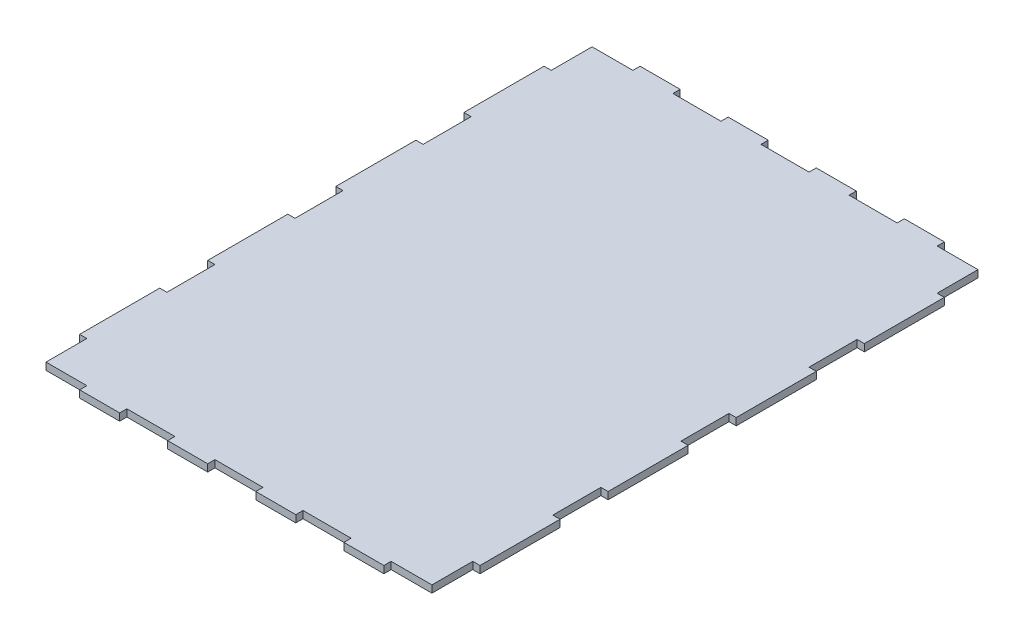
ISO-10303-21;
HEADER;
FILE_DESCRIPTION(('STEP AP214'),'2;1');
FILE_NAME('part.step','',(''),(''),'','','');
FILE_SCHEMA(('AUTOMOTIVE_DESIGN { 1 0 10303 214 1 1 1 1 }'));
ENDSEC;
DATA;
#1=APPLICATION_CONTEXT('core data for automotive mechanical design processes');
#2=APPLICATION_PROTOCOL_DEFINITION('international standard','automotive_design',2000,#1);
#3=PRODUCT_CONTEXT('',#1,'mechanical');
#4=PRODUCT('Part','Part','',(#3));
#5=PRODUCT_RELATED_PRODUCT_CATEGORY('part','',(#4));
#6=PRODUCT_DEFINITION_FORMATION('','',#4);
#7=PRODUCT_DEFINITION_CONTEXT('part definition',#1,'design');
#8=PRODUCT_DEFINITION('design','',#6,#7);
#9=PRODUCT_DEFINITION_SHAPE('','',#8);
#10=(LENGTH_UNIT() NAMED_UNIT(*) SI_UNIT(.MILLI.,.METRE.));
#11=(NAMED_UNIT(*) PLANE_ANGLE_UNIT() SI_UNIT($,.RADIAN.));
#12=(NAMED_UNIT(*) SI_UNIT($,.STERADIAN.) SOLID_ANGLE_UNIT());
#13=UNCERTAINTY_MEASURE_WITH_UNIT(LENGTH_MEASURE(1.E-05),#10,'distance_accuracy_value','');
#14=(GEOMETRIC_REPRESENTATION_CONTEXT(3) GLOBAL_UNCERTAINTY_ASSIGNED_CONTEXT((#13)) GLOBAL_UNIT_ASSIGNED_CONTEXT((#10,
#11,#12)) REPRESENTATION_CONTEXT('',''));
#15=CARTESIAN_POINT('',(0.,0.,0.));
#16=DIRECTION('',(0.,0.,1.));
#17=DIRECTION('',(1.,0.,0.));
#18=AXIS2_PLACEMENT_3D('',#15,#16,#17);
#19=CARTESIAN_POINT('',(241.,9.,-341.));
#20=DIRECTION('',(-1.,0.,0.));
#21=DIRECTION('',(0.,0.,1.));
#22=AXIS2_PLACEMENT_3D('',#19,#20,#21);
#23=PLANE('',#22);
#24=DIRECTION('',(0.,0.,-1.));
#25=VECTOR('',#24,1.);
#26=CARTESIAN_POINT('',(241.,9.,-341.));
#27=LINE('',#26,#25);
#28=CARTESIAN_POINT('',(241.,9.,190.));
#29=VERTEX_POINT('',#28);
#30=CARTESIAN_POINT('',(241.,9.,130.));
#31=VERTEX_POINT('',#30);
#32=EDGE_CURVE('E55',#29,#31,#27,.T.);
#33=ORIENTED_EDGE('',*,*,#32,.F.);
#34=DIRECTION('',(0.,1.,0.));
#35=VECTOR('',#34,1.);
#36=CARTESIAN_POINT('',(241.000000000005,-100.404183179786,190.));
#37=LINE('',#36,#35);
#38=CARTESIAN_POINT('',(241.000000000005,0.,190.));
#39=VERTEX_POINT('',#38);
#40=EDGE_CURVE('E500',#39,#29,#37,.T.);
#41=ORIENTED_EDGE('',*,*,#40,.F.);
#42=DIRECTION('',(0.,0.,-1.));
#43=VECTOR('',#42,1.);
#44=CARTESIAN_POINT('',(241.,0.,-341.));
#45=LINE('',#44,#43);
#46=CARTESIAN_POINT('',(241.,0.,130.));
#47=VERTEX_POINT('',#46);
#48=EDGE_CURVE('E1070',#39,#47,#45,.T.);
#49=ORIENTED_EDGE('',*,*,#48,.T.);
#50=DIRECTION('',(0.,1.,0.));
#51=VECTOR('',#50,1.);
#52=CARTESIAN_POINT('',(241.000000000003,-100.404183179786,130.));
#53=LINE('',#52,#51);
#54=EDGE_CURVE('E565',#47,#31,#53,.T.);
#55=ORIENTED_EDGE('',*,*,#54,.T.);
#56=EDGE_LOOP('',(#33,#41,#49,#55));
#57=FACE_BOUND('',#56,.T.);
#58=ADVANCED_FACE('F39',(#57),#23,.F.);
#59=CARTESIAN_POINT('',(-241.,9.,341.));
#60=DIRECTION('',(1.,0.,0.));
#61=DIRECTION('',(0.,0.,-1.));
#62=AXIS2_PLACEMENT_3D('',#59,#60,#61);
#63=PLANE('',#62);
#64=DIRECTION('',(0.,0.,1.));
#65=VECTOR('',#64,1.);
#66=CARTESIAN_POINT('',(-241.,0.,341.));
#67=LINE('',#66,#65);
#68=CARTESIAN_POINT('',(-240.999999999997,0.,130.));
#69=VERTEX_POINT('',#68);
#70=CARTESIAN_POINT('',(-241.,0.,190.));
#71=VERTEX_POINT('',#70);
#72=EDGE_CURVE('E1179',#69,#71,#67,.T.);
#73=ORIENTED_EDGE('',*,*,#72,.T.);
#74=DIRECTION('',(0.,1.,0.));
#75=VECTOR('',#74,1.);
#76=CARTESIAN_POINT('',(-240.999999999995,-100.404183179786,190.));
#77=LINE('',#76,#75);
#78=CARTESIAN_POINT('',(-241.,9.,190.));
#79=VERTEX_POINT('',#78);
#80=EDGE_CURVE('E515',#71,#79,#77,.T.);
#81=ORIENTED_EDGE('',*,*,#80,.T.);
#82=DIRECTION('',(0.,0.,1.));
#83=VECTOR('',#82,1.);
#84=CARTESIAN_POINT('',(-241.,9.,341.));
#85=LINE('',#84,#83);
#86=CARTESIAN_POINT('',(-241.,9.,130.));
#87=VERTEX_POINT('',#86);
#88=EDGE_CURVE('E2016',#87,#79,#85,.T.);
#89=ORIENTED_EDGE('',*,*,#88,.F.);
#90=DIRECTION('',(0.,1.,0.));
#91=VECTOR('',#90,1.);
#92=CARTESIAN_POINT('',(-240.999999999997,-100.404183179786,130.));
#93=LINE('',#92,#91);
#94=EDGE_CURVE('E604',#69,#87,#93,.T.);
#95=ORIENTED_EDGE('',*,*,#94,.F.);
#96=EDGE_LOOP('',(#73,#81,#89,#95));
#97=FACE_BOUND('',#96,.T.);
#98=ADVANCED_FACE('F1273',(#97),#63,.F.);
#99=CARTESIAN_POINT('',(241.,9.,29.9999999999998));
#100=VERTEX_POINT('',#99);
#101=CARTESIAN_POINT('',(241.,9.,-30.0000000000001));
#102=VERTEX_POINT('',#101);
#103=EDGE_CURVE('E1192',#100,#102,#27,.T.);
#104=ORIENTED_EDGE('',*,*,#103,.F.);
#105=DIRECTION('',(0.,1.,0.));
#106=VECTOR('',#105,1.);
#107=CARTESIAN_POINT('',(241.000000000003,-100.404183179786,29.9999999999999));
#108=LINE('',#107,#106);
#109=CARTESIAN_POINT('',(241.000000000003,0.,29.9999999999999));
#110=VERTEX_POINT('',#109);
#111=EDGE_CURVE('E550',#110,#100,#108,.T.);
#112=ORIENTED_EDGE('',*,*,#111,.F.);
#113=CARTESIAN_POINT('',(241.,0.,-30.0000000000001));
#114=VERTEX_POINT('',#113);
#115=EDGE_CURVE('E1212',#110,#114,#45,.T.);
#116=ORIENTED_EDGE('',*,*,#115,.T.);
#117=DIRECTION('',(0.,1.,0.));
#118=VECTOR('',#117,1.);
#119=CARTESIAN_POINT('',(241.000000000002,-100.404183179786,-30.0000000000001));
#120=LINE('',#119,#118);
#121=EDGE_CURVE('E635',#114,#102,#120,.T.);
#122=ORIENTED_EDGE('',*,*,#121,.T.);
#123=EDGE_LOOP('',(#104,#112,#116,#122));
#124=FACE_BOUND('',#123,.T.);
#125=ADVANCED_FACE('F1211',(#124),#23,.F.);
#126=CARTESIAN_POINT('',(-240.999999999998,0.,-30.0000000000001));
#127=VERTEX_POINT('',#126);
#128=CARTESIAN_POINT('',(-241.,0.,30.));
#129=VERTEX_POINT('',#128);
#130=EDGE_CURVE('E1181',#127,#129,#67,.T.);
#131=ORIENTED_EDGE('',*,*,#130,.T.);
#132=DIRECTION('',(0.,1.,0.));
#133=VECTOR('',#132,1.);
#134=CARTESIAN_POINT('',(-240.999999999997,-100.404183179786,29.9999999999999));
#135=LINE('',#134,#133);
#136=CARTESIAN_POINT('',(-241.,9.,30.));
#137=VERTEX_POINT('',#136);
#138=EDGE_CURVE('E585',#129,#137,#135,.T.);
#139=ORIENTED_EDGE('',*,*,#138,.T.);
#140=CARTESIAN_POINT('',(-241.,9.,-29.9999999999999));
#141=VERTEX_POINT('',#140);
#142=EDGE_CURVE('E2013',#141,#137,#85,.T.);
#143=ORIENTED_EDGE('',*,*,#142,.F.);
#144=DIRECTION('',(0.,1.,0.));
#145=VECTOR('',#144,1.);
#146=CARTESIAN_POINT('',(-240.999999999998,-100.404183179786,-30.0000000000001));
#147=LINE('',#146,#145);
#148=EDGE_CURVE('E675',#127,#141,#147,.T.);
#149=ORIENTED_EDGE('',*,*,#148,.F.);
#150=EDGE_LOOP('',(#131,#139,#143,#149));
#151=FACE_BOUND('',#150,.T.);
#152=ADVANCED_FACE('F1279',(#151),#63,.F.);
#153=CARTESIAN_POINT('',(241.,9.,-130.));
#154=VERTEX_POINT('',#153);
#155=CARTESIAN_POINT('',(241.,9.,-190.));
#156=VERTEX_POINT('',#155);
#157=EDGE_CURVE('E1190',#154,#156,#27,.T.);
#158=ORIENTED_EDGE('',*,*,#157,.F.);
#159=DIRECTION('',(0.,1.,0.));
#160=VECTOR('',#159,1.);
#161=CARTESIAN_POINT('',(241.000000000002,-100.404183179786,-130.));
#162=LINE('',#161,#160);
#163=CARTESIAN_POINT('',(241.000000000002,0.,-130.));
#164=VERTEX_POINT('',#163);
#165=EDGE_CURVE('E620',#164,#154,#162,.T.);
#166=ORIENTED_EDGE('',*,*,#165,.F.);
#167=CARTESIAN_POINT('',(241.,0.,-190.));
#168=VERTEX_POINT('',#167);
#169=EDGE_CURVE('E1233',#164,#168,#45,.T.);
#170=ORIENTED_EDGE('',*,*,#169,.T.);
#171=DIRECTION('',(0.,1.,0.));
#172=VECTOR('',#171,1.);
#173=CARTESIAN_POINT('',(241.,-100.404183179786,-190.));
#174=LINE('',#173,#172);
#175=EDGE_CURVE('E706',#168,#156,#174,.T.);
#176=ORIENTED_EDGE('',*,*,#175,.T.);
#177=EDGE_LOOP('',(#158,#166,#170,#176));
#178=FACE_BOUND('',#177,.T.);
#179=ADVANCED_FACE('F1232',(#178),#23,.F.);
#180=CARTESIAN_POINT('',(-241.,0.,-190.));
#181=VERTEX_POINT('',#180);
#182=CARTESIAN_POINT('',(-241.,0.,-130.));
#183=VERTEX_POINT('',#182);
#184=EDGE_CURVE('E1080',#181,#183,#67,.T.);
#185=ORIENTED_EDGE('',*,*,#184,.T.);
#186=DIRECTION('',(0.,1.,0.));
#187=VECTOR('',#186,1.);
#188=CARTESIAN_POINT('',(-240.999999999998,-100.404183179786,-130.));
#189=LINE('',#188,#187);
#190=CARTESIAN_POINT('',(-241.,9.,-130.));
#191=VERTEX_POINT('',#190);
#192=EDGE_CURVE('E656',#183,#191,#189,.T.);
#193=ORIENTED_EDGE('',*,*,#192,.T.);
#194=CARTESIAN_POINT('',(-241.,9.,-190.));
#195=VERTEX_POINT('',#194);
#196=EDGE_CURVE('E1058',#195,#191,#85,.T.);
#197=ORIENTED_EDGE('',*,*,#196,.F.);
#198=DIRECTION('',(0.,1.,0.));
#199=VECTOR('',#198,1.);
#200=CARTESIAN_POINT('',(-241.,-100.404183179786,-190.));
#201=LINE('',#200,#199);
#202=EDGE_CURVE('E727',#181,#195,#201,.T.);
#203=ORIENTED_EDGE('',*,*,#202,.F.);
#204=EDGE_LOOP('',(#185,#193,#197,#203));
#205=FACE_BOUND('',#204,.T.);
#206=ADVANCED_FACE('F1290',(#205),#63,.F.);
#207=DIRECTION('',(0.,1.,0.));
#208=VECTOR('',#207,1.);
#209=CARTESIAN_POINT('',(241.,-100.404183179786,-290.));
#210=LINE('',#209,#208);
#211=CARTESIAN_POINT('',(241.,0.,-290.));
#212=VERTEX_POINT('',#211);
#213=CARTESIAN_POINT('',(241.,9.,-290.));
#214=VERTEX_POINT('',#213);
#215=EDGE_CURVE('E691',#212,#214,#210,.T.);
#216=ORIENTED_EDGE('',*,*,#215,.F.);
#217=CARTESIAN_POINT('',(241.,0.,-341.));
#218=VERTEX_POINT('',#217);
#219=EDGE_CURVE('E1018',#212,#218,#45,.T.);
#220=ORIENTED_EDGE('',*,*,#219,.T.);
#221=DIRECTION('',(0.,-1.,0.));
#222=VECTOR('',#221,1.);
#223=CARTESIAN_POINT('',(241.,9.,-341.));
#224=LINE('',#223,#222);
#225=CARTESIAN_POINT('',(241.,9.,-341.));
#226=VERTEX_POINT('',#225);
#227=EDGE_CURVE('E11',#226,#218,#224,.T.);
#228=ORIENTED_EDGE('',*,*,#227,.F.);
#229=EDGE_CURVE('E1046',#214,#226,#27,.T.);
#230=ORIENTED_EDGE('',*,*,#229,.F.);
#231=EDGE_LOOP('',(#216,#220,#228,#230));
#232=FACE_BOUND('',#231,.T.);
#233=ADVANCED_FACE('F1249',(#232),#23,.F.);
#234=CARTESIAN_POINT('',(-241.,9.,290.));
#235=VERTEX_POINT('',#234);
#236=CARTESIAN_POINT('',(-241.,9.,341.));
#237=VERTEX_POINT('',#236);
#238=EDGE_CURVE('E1051',#235,#237,#85,.T.);
#239=ORIENTED_EDGE('',*,*,#238,.F.);
#240=DIRECTION('',(0.,1.,0.));
#241=VECTOR('',#240,1.);
#242=CARTESIAN_POINT('',(-240.999999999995,-100.404183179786,290.));
#243=LINE('',#242,#241);
#244=CARTESIAN_POINT('',(-240.999999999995,0.,290.));
#245=VERTEX_POINT('',#244);
#246=EDGE_CURVE('E534',#245,#235,#243,.T.);
#247=ORIENTED_EDGE('',*,*,#246,.F.);
#248=CARTESIAN_POINT('',(-241.,0.,341.));
#249=VERTEX_POINT('',#248);
#250=EDGE_CURVE('E1074',#245,#249,#67,.T.);
#251=ORIENTED_EDGE('',*,*,#250,.T.);
#252=DIRECTION('',(0.,-1.,0.));
#253=VECTOR('',#252,1.);
#254=CARTESIAN_POINT('',(-241.,9.,341.));
#255=LINE('',#254,#253);
#256=EDGE_CURVE('E1089',#237,#249,#255,.T.);
#257=ORIENTED_EDGE('',*,*,#256,.F.);
#258=EDGE_LOOP('',(#239,#247,#251,#257));
#259=FACE_BOUND('',#258,.T.);
#260=ADVANCED_FACE('F1289',(#259),#63,.F.);
#261=CARTESIAN_POINT('',(-241.,9.,341.));
#262=DIRECTION('',(0.,0.,-1.));
#263=DIRECTION('',(-1.,0.,0.));
#264=AXIS2_PLACEMENT_3D('',#261,#262,#263);
#265=PLANE('',#264);
#266=DIRECTION('',(1.,0.,0.));
#267=VECTOR('',#266,1.);
#268=CARTESIAN_POINT('',(-241.,0.,341.));
#269=LINE('',#268,#267);
#270=CARTESIAN_POINT('',(-140.000000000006,0.,341.));
#271=VERTEX_POINT('',#270);
#272=CARTESIAN_POINT('',(-80.0000000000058,0.,341.));
#273=VERTEX_POINT('',#272);
#274=EDGE_CURVE('E1084',#271,#273,#269,.T.);
#275=ORIENTED_EDGE('',*,*,#274,.T.);
#276=DIRECTION('',(0.,1.,0.));
#277=VECTOR('',#276,1.);
#278=CARTESIAN_POINT('',(-80.0000000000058,-50.8035431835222,341.));
#279=LINE('',#278,#277);
#280=CARTESIAN_POINT('',(-80.0000000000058,9.,341.));
#281=VERTEX_POINT('',#280);
#282=EDGE_CURVE('E762',#273,#281,#279,.T.);
#283=ORIENTED_EDGE('',*,*,#282,.T.);
#284=DIRECTION('',(1.,0.,0.));
#285=VECTOR('',#284,1.);
#286=CARTESIAN_POINT('',(-241.,9.,341.));
#287=LINE('',#286,#285);
#288=CARTESIAN_POINT('',(-140.000000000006,9.,341.));
#289=VERTEX_POINT('',#288);
#290=EDGE_CURVE('E1064',#289,#281,#287,.T.);
#291=ORIENTED_EDGE('',*,*,#290,.F.);
#292=DIRECTION('',(0.,1.,0.));
#293=VECTOR('',#292,1.);
#294=CARTESIAN_POINT('',(-140.000000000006,-50.8035431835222,341.));
#295=LINE('',#294,#293);
#296=EDGE_CURVE('E888',#271,#289,#295,.T.);
#297=ORIENTED_EDGE('',*,*,#296,.F.);
#298=EDGE_LOOP('',(#275,#283,#291,#297));
#299=FACE_BOUND('',#298,.T.);
#300=ADVANCED_FACE('F1295',(#299),#265,.F.);
#301=CARTESIAN_POINT('',(-30.0000000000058,9.,341.));
#302=VERTEX_POINT('',#301);
#303=CARTESIAN_POINT('',(29.9999999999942,9.,341.));
#304=VERTEX_POINT('',#303);
#305=EDGE_CURVE('E1065',#302,#304,#287,.T.);
#306=ORIENTED_EDGE('',*,*,#305,.F.);
#307=DIRECTION('',(0.,1.,0.));
#308=VECTOR('',#307,1.);
#309=CARTESIAN_POINT('',(-30.0000000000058,-50.8035431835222,341.));
#310=LINE('',#309,#308);
#311=CARTESIAN_POINT('',(-30.0000000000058,0.,341.));
#312=VERTEX_POINT('',#311);
#313=EDGE_CURVE('E781',#312,#302,#310,.T.);
#314=ORIENTED_EDGE('',*,*,#313,.F.);
#315=CARTESIAN_POINT('',(29.9999999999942,0.,341.));
#316=VERTEX_POINT('',#315);
#317=EDGE_CURVE('E1085',#312,#316,#269,.T.);
#318=ORIENTED_EDGE('',*,*,#317,.T.);
#319=DIRECTION('',(0.,1.,0.));
#320=VECTOR('',#319,1.);
#321=CARTESIAN_POINT('',(29.9999999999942,-50.8035431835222,341.));
#322=LINE('',#321,#320);
#323=EDGE_CURVE('E797',#316,#304,#322,.T.);
#324=ORIENTED_EDGE('',*,*,#323,.T.);
#325=EDGE_LOOP('',(#306,#314,#318,#324));
#326=FACE_BOUND('',#325,.T.);
#327=ADVANCED_FACE('F1862',(#326),#265,.F.);
#328=CARTESIAN_POINT('',(79.9999999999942,9.,341.));
#329=VERTEX_POINT('',#328);
#330=CARTESIAN_POINT('',(139.999999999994,9.,341.));
#331=VERTEX_POINT('',#330);
#332=EDGE_CURVE('E1982',#329,#331,#287,.T.);
#333=ORIENTED_EDGE('',*,*,#332,.F.);
#334=DIRECTION('',(0.,1.,0.));
#335=VECTOR('',#334,1.);
#336=CARTESIAN_POINT('',(79.9999999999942,-50.8035431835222,341.));
#337=LINE('',#336,#335);
#338=CARTESIAN_POINT('',(79.9999999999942,0.,341.));
#339=VERTEX_POINT('',#338);
#340=EDGE_CURVE('E817',#339,#329,#337,.T.);
#341=ORIENTED_EDGE('',*,*,#340,.F.);
#342=CARTESIAN_POINT('',(139.999999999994,0.,341.));
#343=VERTEX_POINT('',#342);
#344=EDGE_CURVE('E1185',#339,#343,#269,.T.);
#345=ORIENTED_EDGE('',*,*,#344,.T.);
#346=DIRECTION('',(0.,1.,0.));
#347=VECTOR('',#346,1.);
#348=CARTESIAN_POINT('',(139.999999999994,-50.8035431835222,341.));
#349=LINE('',#348,#347);
#350=EDGE_CURVE('E833',#343,#331,#349,.T.);
#351=ORIENTED_EDGE('',*,*,#350,.T.);
#352=EDGE_LOOP('',(#333,#341,#345,#351));
#353=FACE_BOUND('',#352,.T.);
#354=ADVANCED_FACE('F1853',(#353),#265,.F.);
#355=CARTESIAN_POINT('',(189.999999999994,9.,341.));
#356=VERTEX_POINT('',#355);
#357=CARTESIAN_POINT('',(241.,9.,341.));
#358=VERTEX_POINT('',#357);
#359=EDGE_CURVE('E1057',#356,#358,#287,.T.);
#360=ORIENTED_EDGE('',*,*,#359,.F.);
#361=DIRECTION('',(0.,1.,0.));
#362=VECTOR('',#361,1.);
#363=CARTESIAN_POINT('',(189.999999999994,-50.8035431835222,341.));
#364=LINE('',#363,#362);
#365=CARTESIAN_POINT('',(189.999999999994,0.,341.));
#366=VERTEX_POINT('',#365);
#367=EDGE_CURVE('E853',#366,#356,#364,.T.);
#368=ORIENTED_EDGE('',*,*,#367,.F.);
#369=CARTESIAN_POINT('',(241.,0.,341.));
#370=VERTEX_POINT('',#369);
#371=EDGE_CURVE('E1079',#366,#370,#269,.T.);
#372=ORIENTED_EDGE('',*,*,#371,.T.);
#373=DIRECTION('',(0.,-1.,0.));
#374=VECTOR('',#373,1.);
#375=CARTESIAN_POINT('',(241.,9.,341.));
#376=LINE('',#375,#374);
#377=EDGE_CURVE('E1063',#358,#370,#376,.T.);
#378=ORIENTED_EDGE('',*,*,#377,.F.);
#379=EDGE_LOOP('',(#360,#368,#372,#378));
#380=FACE_BOUND('',#379,.T.);
#381=ADVANCED_FACE('F1311',(#380),#265,.F.);
#382=CARTESIAN_POINT('',(-241.,9.,-341.));
#383=DIRECTION('',(0.,0.,1.));
#384=DIRECTION('',(1.,0.,0.));
#385=AXIS2_PLACEMENT_3D('',#382,#383,#384);
#386=PLANE('',#385);
#387=DIRECTION('',(-1.,0.,0.));
#388=VECTOR('',#387,1.);
#389=CARTESIAN_POINT('',(-241.,9.,-341.));
#390=LINE('',#389,#388);
#391=CARTESIAN_POINT('',(139.999999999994,9.,-341.));
#392=VERTEX_POINT('',#391);
#393=CARTESIAN_POINT('',(79.9999999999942,9.,-341.));
#394=VERTEX_POINT('',#393);
#395=EDGE_CURVE('E1052',#392,#394,#390,.T.);
#396=ORIENTED_EDGE('',*,*,#395,.F.);
#397=DIRECTION('',(0.,1.,0.));
#398=VECTOR('',#397,1.);
#399=CARTESIAN_POINT('',(139.999999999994,-50.8035431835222,-341.));
#400=LINE('',#399,#398);
#401=CARTESIAN_POINT('',(139.999999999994,0.,-341.));
#402=VERTEX_POINT('',#401);
#403=EDGE_CURVE('E904',#402,#392,#400,.T.);
#404=ORIENTED_EDGE('',*,*,#403,.F.);
#405=DIRECTION('',(-1.,0.,0.));
#406=VECTOR('',#405,1.);
#407=CARTESIAN_POINT('',(-241.,0.,-341.));
#408=LINE('',#407,#406);
#409=CARTESIAN_POINT('',(79.9999999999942,0.,-341.));
#410=VERTEX_POINT('',#409);
#411=EDGE_CURVE('E1075',#402,#410,#408,.T.);
#412=ORIENTED_EDGE('',*,*,#411,.T.);
#413=DIRECTION('',(0.,1.,0.));
#414=VECTOR('',#413,1.);
#415=CARTESIAN_POINT('',(79.9999999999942,-50.8035431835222,-341.));
#416=LINE('',#415,#414);
#417=EDGE_CURVE('E954',#410,#394,#416,.T.);
#418=ORIENTED_EDGE('',*,*,#417,.T.);
#419=EDGE_LOOP('',(#396,#404,#412,#418));
#420=FACE_BOUND('',#419,.T.);
#421=ADVANCED_FACE('F1124',(#420),#386,.F.);
#422=CARTESIAN_POINT('',(29.9999999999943,9.,-341.));
#423=VERTEX_POINT('',#422);
#424=CARTESIAN_POINT('',(-30.0000000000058,9.,-341.));
#425=VERTEX_POINT('',#424);
#426=EDGE_CURVE('E1116',#423,#425,#390,.T.);
#427=ORIENTED_EDGE('',*,*,#426,.F.);
#428=DIRECTION('',(0.,1.,0.));
#429=VECTOR('',#428,1.);
#430=CARTESIAN_POINT('',(29.9999999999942,-50.8035431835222,-341.));
#431=LINE('',#430,#429);
#432=CARTESIAN_POINT('',(29.9999999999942,0.,-341.));
#433=VERTEX_POINT('',#432);
#434=EDGE_CURVE('E939',#433,#423,#431,.T.);
#435=ORIENTED_EDGE('',*,*,#434,.F.);
#436=CARTESIAN_POINT('',(-30.0000000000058,0.,-341.));
#437=VERTEX_POINT('',#436);
#438=EDGE_CURVE('E1141',#433,#437,#408,.T.);
#439=ORIENTED_EDGE('',*,*,#438,.T.);
#440=DIRECTION('',(0.,1.,0.));
#441=VECTOR('',#440,1.);
#442=CARTESIAN_POINT('',(-30.0000000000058,-50.8035431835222,-341.));
#443=LINE('',#442,#441);
#444=EDGE_CURVE('E990',#437,#425,#443,.T.);
#445=ORIENTED_EDGE('',*,*,#444,.T.);
#446=EDGE_LOOP('',(#427,#435,#439,#445));
#447=FACE_BOUND('',#446,.T.);
#448=ADVANCED_FACE('F1140',(#447),#386,.F.);
#449=CARTESIAN_POINT('',(-80.0000000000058,9.,-341.));
#450=VERTEX_POINT('',#449);
#451=CARTESIAN_POINT('',(-140.000000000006,9.,-341.));
#452=VERTEX_POINT('',#451);
#453=EDGE_CURVE('E1114',#450,#452,#390,.T.);
#454=ORIENTED_EDGE('',*,*,#453,.F.);
#455=DIRECTION('',(0.,1.,0.));
#456=VECTOR('',#455,1.);
#457=CARTESIAN_POINT('',(-80.0000000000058,-50.8035431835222,-341.));
#458=LINE('',#457,#456);
#459=CARTESIAN_POINT('',(-80.0000000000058,0.,-341.));
#460=VERTEX_POINT('',#459);
#461=EDGE_CURVE('E975',#460,#450,#458,.T.);
#462=ORIENTED_EDGE('',*,*,#461,.F.);
#463=CARTESIAN_POINT('',(-140.000000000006,0.,-341.));
#464=VERTEX_POINT('',#463);
#465=EDGE_CURVE('E1158',#460,#464,#408,.T.);
#466=ORIENTED_EDGE('',*,*,#465,.T.);
#467=DIRECTION('',(0.,1.,0.));
#468=VECTOR('',#467,1.);
#469=CARTESIAN_POINT('',(-140.000000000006,-50.8035431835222,-341.));
#470=LINE('',#469,#468);
#471=EDGE_CURVE('E1036',#464,#452,#470,.T.);
#472=ORIENTED_EDGE('',*,*,#471,.T.);
#473=EDGE_LOOP('',(#454,#462,#466,#472));
#474=FACE_BOUND('',#473,.T.);
#475=ADVANCED_FACE('F1157',(#474),#386,.F.);
#476=DIRECTION('',(0.,1.,0.));
#477=VECTOR('',#476,1.);
#478=CARTESIAN_POINT('',(-190.000000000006,-50.8035431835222,-341.));
#479=LINE('',#478,#477);
#480=CARTESIAN_POINT('',(-190.000000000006,0.,-341.));
#481=VERTEX_POINT('',#480);
#482=CARTESIAN_POINT('',(-190.000000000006,9.,-341.));
#483=VERTEX_POINT('',#482);
#484=EDGE_CURVE('E1030',#481,#483,#479,.T.);
#485=ORIENTED_EDGE('',*,*,#484,.F.);
#486=CARTESIAN_POINT('',(-241.,0.,-341.));
#487=VERTEX_POINT('',#486);
#488=EDGE_CURVE('E1069',#481,#487,#408,.T.);
#489=ORIENTED_EDGE('',*,*,#488,.T.);
#490=DIRECTION('',(0.,-1.,0.));
#491=VECTOR('',#490,1.);
#492=CARTESIAN_POINT('',(-241.,9.,-341.));
#493=LINE('',#492,#491);
#494=CARTESIAN_POINT('',(-241.,9.,-341.));
#495=VERTEX_POINT('',#494);
#496=EDGE_CURVE('E48',#495,#487,#493,.T.);
#497=ORIENTED_EDGE('',*,*,#496,.F.);
#498=EDGE_CURVE('E1045',#483,#495,#390,.T.);
#499=ORIENTED_EDGE('',*,*,#498,.F.);
#500=EDGE_LOOP('',(#485,#489,#497,#499));
#501=FACE_BOUND('',#500,.T.);
#502=ADVANCED_FACE('F1172',(#501),#386,.F.);
#503=CARTESIAN_POINT('',(241.,0.,290.));
#504=VERTEX_POINT('',#503);
#505=EDGE_CURVE('E1066',#370,#504,#45,.T.);
#506=ORIENTED_EDGE('',*,*,#505,.T.);
#507=DIRECTION('',(0.,1.,0.));
#508=VECTOR('',#507,1.);
#509=CARTESIAN_POINT('',(241.000000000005,-100.404183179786,290.));
#510=LINE('',#509,#508);
#511=CARTESIAN_POINT('',(241.,9.,290.));
#512=VERTEX_POINT('',#511);
#513=EDGE_CURVE('E63',#504,#512,#510,.T.);
#514=ORIENTED_EDGE('',*,*,#513,.T.);
#515=EDGE_CURVE('E491',#358,#512,#27,.T.);
#516=ORIENTED_EDGE('',*,*,#515,.F.);
#517=ORIENTED_EDGE('',*,*,#377,.T.);
#518=EDGE_LOOP('',(#506,#514,#516,#517));
#519=FACE_BOUND('',#518,.T.);
#520=ADVANCED_FACE('F41',(#519),#23,.F.);
#521=CARTESIAN_POINT('',(189.999999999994,0.,-341.));
#522=VERTEX_POINT('',#521);
#523=EDGE_CURVE('E1071',#218,#522,#408,.T.);
#524=ORIENTED_EDGE('',*,*,#523,.T.);
#525=DIRECTION('',(0.,1.,0.));
#526=VECTOR('',#525,1.);
#527=CARTESIAN_POINT('',(189.999999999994,-50.8035431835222,-341.));
#528=LINE('',#527,#526);
#529=CARTESIAN_POINT('',(189.999999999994,9.,-341.));
#530=VERTEX_POINT('',#529);
#531=EDGE_CURVE('E919',#522,#530,#528,.T.);
#532=ORIENTED_EDGE('',*,*,#531,.T.);
#533=EDGE_CURVE('E1047',#226,#530,#390,.T.);
#534=ORIENTED_EDGE('',*,*,#533,.F.);
#535=ORIENTED_EDGE('',*,*,#227,.T.);
#536=EDGE_LOOP('',(#524,#532,#534,#535));
#537=FACE_BOUND('',#536,.T.);
#538=ADVANCED_FACE('F1282',(#537),#386,.F.);
#539=CARTESIAN_POINT('',(-241.,0.,-290.));
#540=VERTEX_POINT('',#539);
#541=EDGE_CURVE('E1076',#487,#540,#67,.T.);
#542=ORIENTED_EDGE('',*,*,#541,.T.);
#543=DIRECTION('',(0.,1.,0.));
#544=VECTOR('',#543,1.);
#545=CARTESIAN_POINT('',(-241.,-100.404183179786,-290.));
#546=LINE('',#545,#544);
#547=CARTESIAN_POINT('',(-241.,9.,-290.));
#548=VERTEX_POINT('',#547);
#549=EDGE_CURVE('E742',#540,#548,#546,.T.);
#550=ORIENTED_EDGE('',*,*,#549,.T.);
#551=EDGE_CURVE('E1053',#495,#548,#85,.T.);
#552=ORIENTED_EDGE('',*,*,#551,.F.);
#553=ORIENTED_EDGE('',*,*,#496,.T.);
#554=EDGE_LOOP('',(#542,#550,#552,#553));
#555=FACE_BOUND('',#554,.T.);
#556=ADVANCED_FACE('F1098',(#555),#63,.F.);
#557=CARTESIAN_POINT('',(-190.000000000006,0.,341.));
#558=VERTEX_POINT('',#557);
#559=EDGE_CURVE('E1081',#249,#558,#269,.T.);
#560=ORIENTED_EDGE('',*,*,#559,.T.);
#561=DIRECTION('',(0.,1.,0.));
#562=VECTOR('',#561,1.);
#563=CARTESIAN_POINT('',(-190.000000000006,-50.8035431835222,341.));
#564=LINE('',#563,#562);
#565=CARTESIAN_POINT('',(-190.000000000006,9.,341.));
#566=VERTEX_POINT('',#565);
#567=EDGE_CURVE('E869',#558,#566,#564,.T.);
#568=ORIENTED_EDGE('',*,*,#567,.T.);
#569=EDGE_CURVE('E1059',#237,#566,#287,.T.);
#570=ORIENTED_EDGE('',*,*,#569,.F.);
#571=ORIENTED_EDGE('',*,*,#256,.T.);
#572=EDGE_LOOP('',(#560,#568,#570,#571));
#573=FACE_BOUND('',#572,.T.);
#574=ADVANCED_FACE('F1307',(#573),#265,.F.);
#575=CARTESIAN_POINT('',(0.,9.,0.));
#576=DIRECTION('',(0.,1.,0.));
#577=DIRECTION('',(0.,0.,1.));
#578=AXIS2_PLACEMENT_3D('',#575,#576,#577);
#579=PLANE('',#578);
#580=ORIENTED_EDGE('',*,*,#515,.T.);
#581=DIRECTION('',(1.,0.,0.));
#582=VECTOR('',#581,1.);
#583=CARTESIAN_POINT('',(241.000000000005,9.,290.));
#584=LINE('',#583,#582);
#585=CARTESIAN_POINT('',(250.000000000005,9.,290.));
#586=VERTEX_POINT('',#585);
#587=EDGE_CURVE('E472',#512,#586,#584,.T.);
#588=ORIENTED_EDGE('',*,*,#587,.T.);
#589=DIRECTION('',(0.,0.,-1.));
#590=VECTOR('',#589,1.);
#591=CARTESIAN_POINT('',(250.000000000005,9.,190.));
#592=LINE('',#591,#590);
#593=CARTESIAN_POINT('',(250.000000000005,9.,190.));
#594=VERTEX_POINT('',#593);
#595=EDGE_CURVE('E481',#586,#594,#592,.T.);
#596=ORIENTED_EDGE('',*,*,#595,.T.);
#597=DIRECTION('',(-1.,0.,0.));
#598=VECTOR('',#597,1.);
#599=CARTESIAN_POINT('',(241.000000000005,9.,190.));
#600=LINE('',#599,#598);
#601=EDGE_CURVE('E488',#594,#29,#600,.T.);
#602=ORIENTED_EDGE('',*,*,#601,.T.);
#603=ORIENTED_EDGE('',*,*,#32,.T.);
#604=DIRECTION('',(1.,0.,0.));
#605=VECTOR('',#604,1.);
#606=CARTESIAN_POINT('',(241.000000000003,9.,130.));
#607=LINE('',#606,#605);
#608=CARTESIAN_POINT('',(250.000000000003,9.,130.));
#609=VERTEX_POINT('',#608);
#610=EDGE_CURVE('E545',#31,#609,#607,.T.);
#611=ORIENTED_EDGE('',*,*,#610,.T.);
#612=DIRECTION('',(0.,0.,-1.));
#613=VECTOR('',#612,1.);
#614=CARTESIAN_POINT('',(250.000000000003,9.,29.9999999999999));
#615=LINE('',#614,#613);
#616=CARTESIAN_POINT('',(250.000000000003,9.,29.9999999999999));
#617=VERTEX_POINT('',#616);
#618=EDGE_CURVE('E557',#609,#617,#615,.T.);
#619=ORIENTED_EDGE('',*,*,#618,.T.);
#620=DIRECTION('',(-1.,0.,0.));
#621=VECTOR('',#620,1.);
#622=CARTESIAN_POINT('',(241.000000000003,9.,29.9999999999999));
#623=LINE('',#622,#621);
#624=EDGE_CURVE('E561',#617,#100,#623,.T.);
#625=ORIENTED_EDGE('',*,*,#624,.T.);
#626=ORIENTED_EDGE('',*,*,#103,.T.);
#627=DIRECTION('',(1.,0.,0.));
#628=VECTOR('',#627,1.);
#629=CARTESIAN_POINT('',(241.000000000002,9.,-30.0000000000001));
#630=LINE('',#629,#628);
#631=CARTESIAN_POINT('',(250.000000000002,9.,-30.0000000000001));
#632=VERTEX_POINT('',#631);
#633=EDGE_CURVE('E615',#102,#632,#630,.T.);
#634=ORIENTED_EDGE('',*,*,#633,.T.);
#635=DIRECTION('',(0.,0.,-1.));
#636=VECTOR('',#635,1.);
#637=CARTESIAN_POINT('',(250.000000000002,9.,-130.));
#638=LINE('',#637,#636);
#639=CARTESIAN_POINT('',(250.000000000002,9.,-130.));
#640=VERTEX_POINT('',#639);
#641=EDGE_CURVE('E627',#632,#640,#638,.T.);
#642=ORIENTED_EDGE('',*,*,#641,.T.);
#643=DIRECTION('',(-1.,0.,0.));
#644=VECTOR('',#643,1.);
#645=CARTESIAN_POINT('',(241.000000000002,9.,-130.));
#646=LINE('',#645,#644);
#647=EDGE_CURVE('E631',#640,#154,#646,.T.);
#648=ORIENTED_EDGE('',*,*,#647,.T.);
#649=ORIENTED_EDGE('',*,*,#157,.T.);
#650=DIRECTION('',(1.,0.,0.));
#651=VECTOR('',#650,1.);
#652=CARTESIAN_POINT('',(241.,9.,-190.));
#653=LINE('',#652,#651);
#654=CARTESIAN_POINT('',(250.,9.,-190.));
#655=VERTEX_POINT('',#654);
#656=EDGE_CURVE('E686',#156,#655,#653,.T.);
#657=ORIENTED_EDGE('',*,*,#656,.T.);
#658=DIRECTION('',(0.,0.,-1.));
#659=VECTOR('',#658,1.);
#660=CARTESIAN_POINT('',(250.,9.,-290.));
#661=LINE('',#660,#659);
#662=CARTESIAN_POINT('',(250.,9.,-290.));
#663=VERTEX_POINT('',#662);
#664=EDGE_CURVE('E698',#655,#663,#661,.T.);
#665=ORIENTED_EDGE('',*,*,#664,.T.);
#666=DIRECTION('',(-1.,0.,0.));
#667=VECTOR('',#666,1.);
#668=CARTESIAN_POINT('',(241.,9.,-290.));
#669=LINE('',#668,#667);
#670=EDGE_CURVE('E702',#663,#214,#669,.T.);
#671=ORIENTED_EDGE('',*,*,#670,.T.);
#672=ORIENTED_EDGE('',*,*,#229,.T.);
#673=ORIENTED_EDGE('',*,*,#533,.T.);
#674=DIRECTION('',(0.,0.,-1.));
#675=VECTOR('',#674,1.);
#676=CARTESIAN_POINT('',(189.999999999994,9.,-341.));
#677=LINE('',#676,#675);
#678=CARTESIAN_POINT('',(189.999999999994,9.,-350.));
#679=VERTEX_POINT('',#678);
#680=EDGE_CURVE('E899',#530,#679,#677,.T.);
#681=ORIENTED_EDGE('',*,*,#680,.T.);
#682=DIRECTION('',(-1.,0.,0.));
#683=VECTOR('',#682,1.);
#684=CARTESIAN_POINT('',(139.999999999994,9.,-350.));
#685=LINE('',#684,#683);
#686=CARTESIAN_POINT('',(139.999999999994,9.,-350.));
#687=VERTEX_POINT('',#686);
#688=EDGE_CURVE('E911',#679,#687,#685,.T.);
#689=ORIENTED_EDGE('',*,*,#688,.T.);
#690=DIRECTION('',(0.,0.,1.));
#691=VECTOR('',#690,1.);
#692=CARTESIAN_POINT('',(139.999999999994,9.,-341.));
#693=LINE('',#692,#691);
#694=EDGE_CURVE('E915',#687,#392,#693,.T.);
#695=ORIENTED_EDGE('',*,*,#694,.T.);
#696=ORIENTED_EDGE('',*,*,#395,.T.);
#697=DIRECTION('',(0.,0.,-1.));
#698=VECTOR('',#697,1.);
#699=CARTESIAN_POINT('',(79.9999999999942,9.,-341.));
#700=LINE('',#699,#698);
#701=CARTESIAN_POINT('',(79.9999999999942,9.,-350.));
#702=VERTEX_POINT('',#701);
#703=EDGE_CURVE('E934',#394,#702,#700,.T.);
#704=ORIENTED_EDGE('',*,*,#703,.T.);
#705=DIRECTION('',(-1.,0.,0.));
#706=VECTOR('',#705,1.);
#707=CARTESIAN_POINT('',(29.9999999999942,9.,-350.));
#708=LINE('',#707,#706);
#709=CARTESIAN_POINT('',(29.9999999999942,9.,-350.));
#710=VERTEX_POINT('',#709);
#711=EDGE_CURVE('E946',#702,#710,#708,.T.);
#712=ORIENTED_EDGE('',*,*,#711,.T.);
#713=DIRECTION('',(0.,0.,1.));
#714=VECTOR('',#713,1.);
#715=CARTESIAN_POINT('',(29.9999999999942,9.,-341.));
#716=LINE('',#715,#714);
#717=EDGE_CURVE('E950',#710,#423,#716,.T.);
#718=ORIENTED_EDGE('',*,*,#717,.T.);
#719=ORIENTED_EDGE('',*,*,#426,.T.);
#720=DIRECTION('',(0.,0.,-1.));
#721=VECTOR('',#720,1.);
#722=CARTESIAN_POINT('',(-30.0000000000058,9.,-341.));
#723=LINE('',#722,#721);
#724=CARTESIAN_POINT('',(-30.0000000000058,9.,-350.));
#725=VERTEX_POINT('',#724);
#726=EDGE_CURVE('E970',#425,#725,#723,.T.);
#727=ORIENTED_EDGE('',*,*,#726,.T.);
#728=DIRECTION('',(-1.,0.,0.));
#729=VECTOR('',#728,1.);
#730=CARTESIAN_POINT('',(-80.0000000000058,9.,-350.));
#731=LINE('',#730,#729);
#732=CARTESIAN_POINT('',(-80.0000000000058,9.,-350.));
#733=VERTEX_POINT('',#732);
#734=EDGE_CURVE('E982',#725,#733,#731,.T.);
#735=ORIENTED_EDGE('',*,*,#734,.T.);
#736=DIRECTION('',(0.,0.,1.));
#737=VECTOR('',#736,1.);
#738=CARTESIAN_POINT('',(-80.0000000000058,9.,-341.));
#739=LINE('',#738,#737);
#740=EDGE_CURVE('E986',#733,#450,#739,.T.);
#741=ORIENTED_EDGE('',*,*,#740,.T.);
#742=ORIENTED_EDGE('',*,*,#453,.T.);
#743=DIRECTION('',(0.,0.,-1.));
#744=VECTOR('',#743,1.);
#745=CARTESIAN_POINT('',(-140.000000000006,9.,-341.));
#746=LINE('',#745,#744);
#747=CARTESIAN_POINT('',(-140.000000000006,9.,-350.));
#748=VERTEX_POINT('',#747);
#749=EDGE_CURVE('E1022',#452,#748,#746,.T.);
#750=ORIENTED_EDGE('',*,*,#749,.T.);
#751=DIRECTION('',(-1.,0.,0.));
#752=VECTOR('',#751,1.);
#753=CARTESIAN_POINT('',(-190.000000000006,9.,-350.));
#754=LINE('',#753,#752);
#755=CARTESIAN_POINT('',(-190.000000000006,9.,-350.));
#756=VERTEX_POINT('',#755);
#757=EDGE_CURVE('E1026',#748,#756,#754,.T.);
#758=ORIENTED_EDGE('',*,*,#757,.T.);
#759=DIRECTION('',(0.,0.,1.));
#760=VECTOR('',#759,1.);
#761=CARTESIAN_POINT('',(-190.000000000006,9.,-341.));
#762=LINE('',#761,#760);
#763=EDGE_CURVE('E1006',#756,#483,#762,.T.);
#764=ORIENTED_EDGE('',*,*,#763,.T.);
#765=ORIENTED_EDGE('',*,*,#498,.T.);
#766=ORIENTED_EDGE('',*,*,#551,.T.);
#767=DIRECTION('',(-1.,0.,0.));
#768=VECTOR('',#767,1.);
#769=CARTESIAN_POINT('',(-241.,9.,-290.));
#770=LINE('',#769,#768);
#771=CARTESIAN_POINT('',(-250.,9.,-290.));
#772=VERTEX_POINT('',#771);
#773=EDGE_CURVE('E722',#548,#772,#770,.T.);
#774=ORIENTED_EDGE('',*,*,#773,.T.);
#775=DIRECTION('',(0.,0.,1.));
#776=VECTOR('',#775,1.);
#777=CARTESIAN_POINT('',(-250.,9.,-290.));
#778=LINE('',#777,#776);
#779=CARTESIAN_POINT('',(-250.,9.,-190.));
#780=VERTEX_POINT('',#779);
#781=EDGE_CURVE('E734',#772,#780,#778,.T.);
#782=ORIENTED_EDGE('',*,*,#781,.T.);
#783=DIRECTION('',(1.,0.,0.));
#784=VECTOR('',#783,1.);
#785=CARTESIAN_POINT('',(-241.,9.,-190.));
#786=LINE('',#785,#784);
#787=EDGE_CURVE('E738',#780,#195,#786,.T.);
#788=ORIENTED_EDGE('',*,*,#787,.T.);
#789=ORIENTED_EDGE('',*,*,#196,.T.);
#790=DIRECTION('',(-1.,0.,0.));
#791=VECTOR('',#790,1.);
#792=CARTESIAN_POINT('',(-240.999999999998,9.,-130.));
#793=LINE('',#792,#791);
#794=CARTESIAN_POINT('',(-249.999999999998,9.,-130.));
#795=VERTEX_POINT('',#794);
#796=EDGE_CURVE('E651',#191,#795,#793,.T.);
#797=ORIENTED_EDGE('',*,*,#796,.T.);
#798=DIRECTION('',(0.,0.,1.));
#799=VECTOR('',#798,1.);
#800=CARTESIAN_POINT('',(-249.999999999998,9.,-130.));
#801=LINE('',#800,#799);
#802=CARTESIAN_POINT('',(-249.999999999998,9.,-30.0000000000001));
#803=VERTEX_POINT('',#802);
#804=EDGE_CURVE('E664',#795,#803,#801,.T.);
#805=ORIENTED_EDGE('',*,*,#804,.T.);
#806=DIRECTION('',(1.,0.,0.));
#807=VECTOR('',#806,1.);
#808=CARTESIAN_POINT('',(-240.999999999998,9.,-30.0000000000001));
#809=LINE('',#808,#807);
#810=EDGE_CURVE('E668',#803,#141,#809,.T.);
#811=ORIENTED_EDGE('',*,*,#810,.T.);
#812=ORIENTED_EDGE('',*,*,#142,.T.);
#813=DIRECTION('',(-1.,0.,0.));
#814=VECTOR('',#813,1.);
#815=CARTESIAN_POINT('',(-240.999999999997,9.,29.9999999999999));
#816=LINE('',#815,#814);
#817=CARTESIAN_POINT('',(-249.999999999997,9.,29.9999999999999));
#818=VERTEX_POINT('',#817);
#819=EDGE_CURVE('E580',#137,#818,#816,.T.);
#820=ORIENTED_EDGE('',*,*,#819,.T.);
#821=DIRECTION('',(0.,0.,1.));
#822=VECTOR('',#821,1.);
#823=CARTESIAN_POINT('',(-249.999999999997,9.,29.9999999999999));
#824=LINE('',#823,#822);
#825=CARTESIAN_POINT('',(-249.999999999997,9.,130.));
#826=VERTEX_POINT('',#825);
#827=EDGE_CURVE('E593',#818,#826,#824,.T.);
#828=ORIENTED_EDGE('',*,*,#827,.T.);
#829=DIRECTION('',(1.,0.,0.));
#830=VECTOR('',#829,1.);
#831=CARTESIAN_POINT('',(-240.999999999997,9.,130.));
#832=LINE('',#831,#830);
#833=EDGE_CURVE('E597',#826,#87,#832,.T.);
#834=ORIENTED_EDGE('',*,*,#833,.T.);
#835=ORIENTED_EDGE('',*,*,#88,.T.);
#836=DIRECTION('',(-1.,0.,0.));
#837=VECTOR('',#836,1.);
#838=CARTESIAN_POINT('',(-240.999999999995,9.,190.));
#839=LINE('',#838,#837);
#840=CARTESIAN_POINT('',(-249.999999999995,9.,190.));
#841=VERTEX_POINT('',#840);
#842=EDGE_CURVE('E510',#79,#841,#839,.T.);
#843=ORIENTED_EDGE('',*,*,#842,.T.);
#844=DIRECTION('',(0.,0.,1.));
#845=VECTOR('',#844,1.);
#846=CARTESIAN_POINT('',(-249.999999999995,9.,190.));
#847=LINE('',#846,#845);
#848=CARTESIAN_POINT('',(-249.999999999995,9.,290.));
#849=VERTEX_POINT('',#848);
#850=EDGE_CURVE('E523',#841,#849,#847,.T.);
#851=ORIENTED_EDGE('',*,*,#850,.T.);
#852=DIRECTION('',(1.,0.,0.));
#853=VECTOR('',#852,1.);
#854=CARTESIAN_POINT('',(-240.999999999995,9.,290.));
#855=LINE('',#854,#853);
#856=EDGE_CURVE('E527',#849,#235,#855,.T.);
#857=ORIENTED_EDGE('',*,*,#856,.T.);
#858=ORIENTED_EDGE('',*,*,#238,.T.);
#859=ORIENTED_EDGE('',*,*,#569,.T.);
#860=DIRECTION('',(0.,0.,1.));
#861=VECTOR('',#860,1.);
#862=CARTESIAN_POINT('',(-190.000000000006,9.,341.));
#863=LINE('',#862,#861);
#864=CARTESIAN_POINT('',(-190.000000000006,9.,350.));
#865=VERTEX_POINT('',#864);
#866=EDGE_CURVE('E864',#566,#865,#863,.T.);
#867=ORIENTED_EDGE('',*,*,#866,.T.);
#868=DIRECTION('',(1.,0.,0.));
#869=VECTOR('',#868,1.);
#870=CARTESIAN_POINT('',(-190.000000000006,9.,350.));
#871=LINE('',#870,#869);
#872=CARTESIAN_POINT('',(-140.000000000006,9.,350.));
#873=VERTEX_POINT('',#872);
#874=EDGE_CURVE('E877',#865,#873,#871,.T.);
#875=ORIENTED_EDGE('',*,*,#874,.T.);
#876=DIRECTION('',(0.,0.,-1.));
#877=VECTOR('',#876,1.);
#878=CARTESIAN_POINT('',(-140.000000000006,9.,341.));
#879=LINE('',#878,#877);
#880=EDGE_CURVE('E881',#873,#289,#879,.T.);
#881=ORIENTED_EDGE('',*,*,#880,.T.);
#882=ORIENTED_EDGE('',*,*,#290,.T.);
#883=DIRECTION('',(0.,0.,1.));
#884=VECTOR('',#883,1.);
#885=CARTESIAN_POINT('',(-80.0000000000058,9.,341.));
#886=LINE('',#885,#884);
#887=CARTESIAN_POINT('',(-80.0000000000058,9.,350.));
#888=VERTEX_POINT('',#887);
#889=EDGE_CURVE('E757',#281,#888,#886,.T.);
#890=ORIENTED_EDGE('',*,*,#889,.T.);
#891=DIRECTION('',(1.,0.,0.));
#892=VECTOR('',#891,1.);
#893=CARTESIAN_POINT('',(-80.0000000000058,9.,350.));
#894=LINE('',#893,#892);
#895=CARTESIAN_POINT('',(-30.0000000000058,9.,350.));
#896=VERTEX_POINT('',#895);
#897=EDGE_CURVE('E770',#888,#896,#894,.T.);
#898=ORIENTED_EDGE('',*,*,#897,.T.);
#899=DIRECTION('',(0.,0.,-1.));
#900=VECTOR('',#899,1.);
#901=CARTESIAN_POINT('',(-30.0000000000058,9.,341.));
#902=LINE('',#901,#900);
#903=EDGE_CURVE('E774',#896,#302,#902,.T.);
#904=ORIENTED_EDGE('',*,*,#903,.T.);
#905=ORIENTED_EDGE('',*,*,#305,.T.);
#906=DIRECTION('',(0.,0.,1.));
#907=VECTOR('',#906,1.);
#908=CARTESIAN_POINT('',(29.9999999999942,9.,341.));
#909=LINE('',#908,#907);
#910=CARTESIAN_POINT('',(29.9999999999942,9.,350.));
#911=VERTEX_POINT('',#910);
#912=EDGE_CURVE('E792',#304,#911,#909,.T.);
#913=ORIENTED_EDGE('',*,*,#912,.T.);
#914=DIRECTION('',(1.,0.,0.));
#915=VECTOR('',#914,1.);
#916=CARTESIAN_POINT('',(29.9999999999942,9.,350.));
#917=LINE('',#916,#915);
#918=CARTESIAN_POINT('',(79.9999999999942,9.,350.));
#919=VERTEX_POINT('',#918);
#920=EDGE_CURVE('E805',#911,#919,#917,.T.);
#921=ORIENTED_EDGE('',*,*,#920,.T.);
#922=DIRECTION('',(0.,0.,-1.));
#923=VECTOR('',#922,1.);
#924=CARTESIAN_POINT('',(79.9999999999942,9.,341.));
#925=LINE('',#924,#923);
#926=EDGE_CURVE('E809',#919,#329,#925,.T.);
#927=ORIENTED_EDGE('',*,*,#926,.T.);
#928=ORIENTED_EDGE('',*,*,#332,.T.);
#929=DIRECTION('',(0.,0.,1.));
#930=VECTOR('',#929,1.);
#931=CARTESIAN_POINT('',(139.999999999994,9.,341.));
#932=LINE('',#931,#930);
#933=CARTESIAN_POINT('',(139.999999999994,9.,350.));
#934=VERTEX_POINT('',#933);
#935=EDGE_CURVE('E828',#331,#934,#932,.T.);
#936=ORIENTED_EDGE('',*,*,#935,.T.);
#937=DIRECTION('',(1.,0.,0.));
#938=VECTOR('',#937,1.);
#939=CARTESIAN_POINT('',(139.999999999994,9.,350.));
#940=LINE('',#939,#938);
#941=CARTESIAN_POINT('',(189.999999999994,9.,350.));
#942=VERTEX_POINT('',#941);
#943=EDGE_CURVE('E841',#934,#942,#940,.T.);
#944=ORIENTED_EDGE('',*,*,#943,.T.);
#945=DIRECTION('',(0.,0.,-1.));
#946=VECTOR('',#945,1.);
#947=CARTESIAN_POINT('',(189.999999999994,9.,341.));
#948=LINE('',#947,#946);
#949=EDGE_CURVE('E845',#942,#356,#948,.T.);
#950=ORIENTED_EDGE('',*,*,#949,.T.);
#951=ORIENTED_EDGE('',*,*,#359,.T.);
#952=EDGE_LOOP('',(#580,#588,#596,#602,#603,#611,#619,#625,#626,#634,#642,#648,#649,#657,#665,
#671,#672,#673,#681,#689,#695,#696,#704,#712,#718,#719,#727,#735,#741,#742,#750,#758,#764,#765,
#766,#774,#782,#788,#789,#797,#805,#811,#812,#820,#828,#834,#835,#843,#851,#857,#858,#859,#867,
#875,#881,#882,#890,#898,#904,#905,#913,#921,#927,#928,#936,#944,#950,#951));
#953=FACE_BOUND('',#952,.T.);
#954=ADVANCED_FACE('F490',(#953),#579,.T.);
#955=CARTESIAN_POINT('',(0.,0.,0.));
#956=DIRECTION('',(0.,1.,0.));
#957=DIRECTION('',(0.,0.,1.));
#958=AXIS2_PLACEMENT_3D('',#955,#956,#957);
#959=PLANE('',#958);
#960=ORIENTED_EDGE('',*,*,#505,.F.);
#961=ORIENTED_EDGE('',*,*,#371,.F.);
#962=DIRECTION('',(0.,0.,1.));
#963=VECTOR('',#962,1.);
#964=CARTESIAN_POINT('',(189.999999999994,0.,341.));
#965=LINE('',#964,#963);
#966=CARTESIAN_POINT('',(189.999999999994,0.,350.));
#967=VERTEX_POINT('',#966);
#968=EDGE_CURVE('E829',#366,#967,#965,.T.);
#969=ORIENTED_EDGE('',*,*,#968,.T.);
#970=DIRECTION('',(-1.,0.,0.));
#971=VECTOR('',#970,1.);
#972=CARTESIAN_POINT('',(139.999999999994,0.,350.));
#973=LINE('',#972,#971);
#974=CARTESIAN_POINT('',(139.999999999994,0.,350.));
#975=VERTEX_POINT('',#974);
#976=EDGE_CURVE('E837',#967,#975,#973,.T.);
#977=ORIENTED_EDGE('',*,*,#976,.T.);
#978=DIRECTION('',(0.,0.,-1.));
#979=VECTOR('',#978,1.);
#980=CARTESIAN_POINT('',(139.999999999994,0.,341.));
#981=LINE('',#980,#979);
#982=EDGE_CURVE('E832',#975,#343,#981,.T.);
#983=ORIENTED_EDGE('',*,*,#982,.T.);
#984=ORIENTED_EDGE('',*,*,#344,.F.);
#985=DIRECTION('',(0.,0.,1.));
#986=VECTOR('',#985,1.);
#987=CARTESIAN_POINT('',(79.9999999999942,0.,341.));
#988=LINE('',#987,#986);
#989=CARTESIAN_POINT('',(79.9999999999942,0.,350.));
#990=VERTEX_POINT('',#989);
#991=EDGE_CURVE('E793',#339,#990,#988,.T.);
#992=ORIENTED_EDGE('',*,*,#991,.T.);
#993=DIRECTION('',(-1.,0.,0.));
#994=VECTOR('',#993,1.);
#995=CARTESIAN_POINT('',(29.9999999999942,0.,350.));
#996=LINE('',#995,#994);
#997=CARTESIAN_POINT('',(29.9999999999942,0.,350.));
#998=VERTEX_POINT('',#997);
#999=EDGE_CURVE('E801',#990,#998,#996,.T.);
#1000=ORIENTED_EDGE('',*,*,#999,.T.);
#1001=DIRECTION('',(0.,0.,-1.));
#1002=VECTOR('',#1001,1.);
#1003=CARTESIAN_POINT('',(29.9999999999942,0.,341.));
#1004=LINE('',#1003,#1002);
#1005=EDGE_CURVE('E796',#998,#316,#1004,.T.);
#1006=ORIENTED_EDGE('',*,*,#1005,.T.);
#1007=ORIENTED_EDGE('',*,*,#317,.F.);
#1008=DIRECTION('',(0.,0.,1.));
#1009=VECTOR('',#1008,1.);
#1010=CARTESIAN_POINT('',(-30.0000000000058,0.,341.));
#1011=LINE('',#1010,#1009);
#1012=CARTESIAN_POINT('',(-30.0000000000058,0.,350.));
#1013=VERTEX_POINT('',#1012);
#1014=EDGE_CURVE('E758',#312,#1013,#1011,.T.);
#1015=ORIENTED_EDGE('',*,*,#1014,.T.);
#1016=DIRECTION('',(-1.,0.,0.));
#1017=VECTOR('',#1016,1.);
#1018=CARTESIAN_POINT('',(-80.0000000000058,0.,350.));
#1019=LINE('',#1018,#1017);
#1020=CARTESIAN_POINT('',(-80.0000000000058,0.,350.));
#1021=VERTEX_POINT('',#1020);
#1022=EDGE_CURVE('E766',#1013,#1021,#1019,.T.);
#1023=ORIENTED_EDGE('',*,*,#1022,.T.);
#1024=DIRECTION('',(0.,0.,-1.));
#1025=VECTOR('',#1024,1.);
#1026=CARTESIAN_POINT('',(-80.0000000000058,0.,341.));
#1027=LINE('',#1026,#1025);
#1028=EDGE_CURVE('E761',#1021,#273,#1027,.T.);
#1029=ORIENTED_EDGE('',*,*,#1028,.T.);
#1030=ORIENTED_EDGE('',*,*,#274,.F.);
#1031=DIRECTION('',(0.,0.,1.));
#1032=VECTOR('',#1031,1.);
#1033=CARTESIAN_POINT('',(-140.000000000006,0.,341.));
#1034=LINE('',#1033,#1032);
#1035=CARTESIAN_POINT('',(-140.000000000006,0.,350.));
#1036=VERTEX_POINT('',#1035);
#1037=EDGE_CURVE('E865',#271,#1036,#1034,.T.);
#1038=ORIENTED_EDGE('',*,*,#1037,.T.);
#1039=DIRECTION('',(-1.,0.,0.));
#1040=VECTOR('',#1039,1.);
#1041=CARTESIAN_POINT('',(-190.000000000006,0.,350.));
#1042=LINE('',#1041,#1040);
#1043=CARTESIAN_POINT('',(-190.000000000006,0.,350.));
#1044=VERTEX_POINT('',#1043);
#1045=EDGE_CURVE('E873',#1036,#1044,#1042,.T.);
#1046=ORIENTED_EDGE('',*,*,#1045,.T.);
#1047=DIRECTION('',(0.,0.,-1.));
#1048=VECTOR('',#1047,1.);
#1049=CARTESIAN_POINT('',(-190.000000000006,0.,341.));
#1050=LINE('',#1049,#1048);
#1051=EDGE_CURVE('E868',#1044,#558,#1050,.T.);
#1052=ORIENTED_EDGE('',*,*,#1051,.T.);
#1053=ORIENTED_EDGE('',*,*,#559,.F.);
#1054=ORIENTED_EDGE('',*,*,#250,.F.);
#1055=DIRECTION('',(-1.,0.,0.));
#1056=VECTOR('',#1055,1.);
#1057=CARTESIAN_POINT('',(-240.999999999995,0.,290.));
#1058=LINE('',#1057,#1056);
#1059=CARTESIAN_POINT('',(-249.999999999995,0.,290.));
#1060=VERTEX_POINT('',#1059);
#1061=EDGE_CURVE('E511',#245,#1060,#1058,.T.);
#1062=ORIENTED_EDGE('',*,*,#1061,.T.);
#1063=DIRECTION('',(0.,0.,-1.));
#1064=VECTOR('',#1063,1.);
#1065=CARTESIAN_POINT('',(-249.999999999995,0.,190.));
#1066=LINE('',#1065,#1064);
#1067=CARTESIAN_POINT('',(-249.999999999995,0.,190.));
#1068=VERTEX_POINT('',#1067);
#1069=EDGE_CURVE('E519',#1060,#1068,#1066,.T.);
#1070=ORIENTED_EDGE('',*,*,#1069,.T.);
#1071=DIRECTION('',(1.,0.,0.));
#1072=VECTOR('',#1071,1.);
#1073=CARTESIAN_POINT('',(-240.999999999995,0.,190.));
#1074=LINE('',#1073,#1072);
#1075=EDGE_CURVE('E514',#1068,#71,#1074,.T.);
#1076=ORIENTED_EDGE('',*,*,#1075,.T.);
#1077=ORIENTED_EDGE('',*,*,#72,.F.);
#1078=DIRECTION('',(-1.,0.,0.));
#1079=VECTOR('',#1078,1.);
#1080=CARTESIAN_POINT('',(-240.999999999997,0.,130.));
#1081=LINE('',#1080,#1079);
#1082=CARTESIAN_POINT('',(-249.999999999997,0.,130.));
#1083=VERTEX_POINT('',#1082);
#1084=EDGE_CURVE('E581',#69,#1083,#1081,.T.);
#1085=ORIENTED_EDGE('',*,*,#1084,.T.);
#1086=DIRECTION('',(0.,0.,-1.));
#1087=VECTOR('',#1086,1.);
#1088=CARTESIAN_POINT('',(-249.999999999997,0.,29.9999999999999));
#1089=LINE('',#1088,#1087);
#1090=CARTESIAN_POINT('',(-249.999999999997,0.,29.9999999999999));
#1091=VERTEX_POINT('',#1090);
#1092=EDGE_CURVE('E589',#1083,#1091,#1089,.T.);
#1093=ORIENTED_EDGE('',*,*,#1092,.T.);
#1094=DIRECTION('',(1.,0.,0.));
#1095=VECTOR('',#1094,1.);
#1096=CARTESIAN_POINT('',(-240.999999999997,0.,29.9999999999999));
#1097=LINE('',#1096,#1095);
#1098=EDGE_CURVE('E584',#1091,#129,#1097,.T.);
#1099=ORIENTED_EDGE('',*,*,#1098,.T.);
#1100=ORIENTED_EDGE('',*,*,#130,.F.);
#1101=DIRECTION('',(-1.,0.,0.));
#1102=VECTOR('',#1101,1.);
#1103=CARTESIAN_POINT('',(-240.999999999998,0.,-30.0000000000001));
#1104=LINE('',#1103,#1102);
#1105=CARTESIAN_POINT('',(-249.999999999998,0.,-30.0000000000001));
#1106=VERTEX_POINT('',#1105);
#1107=EDGE_CURVE('E652',#127,#1106,#1104,.T.);
#1108=ORIENTED_EDGE('',*,*,#1107,.T.);
#1109=DIRECTION('',(0.,0.,-1.));
#1110=VECTOR('',#1109,1.);
#1111=CARTESIAN_POINT('',(-249.999999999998,0.,-130.));
#1112=LINE('',#1111,#1110);
#1113=CARTESIAN_POINT('',(-249.999999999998,0.,-130.));
#1114=VERTEX_POINT('',#1113);
#1115=EDGE_CURVE('E660',#1106,#1114,#1112,.T.);
#1116=ORIENTED_EDGE('',*,*,#1115,.T.);
#1117=DIRECTION('',(1.,0.,0.));
#1118=VECTOR('',#1117,1.);
#1119=CARTESIAN_POINT('',(-240.999999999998,0.,-130.));
#1120=LINE('',#1119,#1118);
#1121=EDGE_CURVE('E655',#1114,#183,#1120,.T.);
#1122=ORIENTED_EDGE('',*,*,#1121,.T.);
#1123=ORIENTED_EDGE('',*,*,#184,.F.);
#1124=DIRECTION('',(-1.,0.,0.));
#1125=VECTOR('',#1124,1.);
#1126=CARTESIAN_POINT('',(-241.,0.,-190.));
#1127=LINE('',#1126,#1125);
#1128=CARTESIAN_POINT('',(-250.,0.,-190.));
#1129=VERTEX_POINT('',#1128);
#1130=EDGE_CURVE('E726',#181,#1129,#1127,.T.);
#1131=ORIENTED_EDGE('',*,*,#1130,.T.);
#1132=DIRECTION('',(0.,0.,-1.));
#1133=VECTOR('',#1132,1.);
#1134=CARTESIAN_POINT('',(-250.,0.,-290.));
#1135=LINE('',#1134,#1133);
#1136=CARTESIAN_POINT('',(-250.,0.,-290.));
#1137=VERTEX_POINT('',#1136);
#1138=EDGE_CURVE('E723',#1129,#1137,#1135,.T.);
#1139=ORIENTED_EDGE('',*,*,#1138,.T.);
#1140=DIRECTION('',(1.,0.,0.));
#1141=VECTOR('',#1140,1.);
#1142=CARTESIAN_POINT('',(-241.,0.,-290.));
#1143=LINE('',#1142,#1141);
#1144=EDGE_CURVE('E730',#1137,#540,#1143,.T.);
#1145=ORIENTED_EDGE('',*,*,#1144,.T.);
#1146=ORIENTED_EDGE('',*,*,#541,.F.);
#1147=ORIENTED_EDGE('',*,*,#488,.F.);
#1148=DIRECTION('',(0.,0.,-1.));
#1149=VECTOR('',#1148,1.);
#1150=CARTESIAN_POINT('',(-190.000000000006,0.,-341.));
#1151=LINE('',#1150,#1149);
#1152=CARTESIAN_POINT('',(-190.000000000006,0.,-350.));
#1153=VERTEX_POINT('',#1152);
#1154=EDGE_CURVE('E1015',#481,#1153,#1151,.T.);
#1155=ORIENTED_EDGE('',*,*,#1154,.T.);
#1156=DIRECTION('',(1.,0.,0.));
#1157=VECTOR('',#1156,1.);
#1158=CARTESIAN_POINT('',(-190.000000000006,0.,-350.));
#1159=LINE('',#1158,#1157);
#1160=CARTESIAN_POINT('',(-140.000000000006,0.,-350.));
#1161=VERTEX_POINT('',#1160);
#1162=EDGE_CURVE('E1011',#1153,#1161,#1159,.T.);
#1163=ORIENTED_EDGE('',*,*,#1162,.T.);
#1164=DIRECTION('',(0.,0.,1.));
#1165=VECTOR('',#1164,1.);
#1166=CARTESIAN_POINT('',(-140.000000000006,0.,-341.));
#1167=LINE('',#1166,#1165);
#1168=EDGE_CURVE('E1007',#1161,#464,#1167,.T.);
#1169=ORIENTED_EDGE('',*,*,#1168,.T.);
#1170=ORIENTED_EDGE('',*,*,#465,.F.);
#1171=DIRECTION('',(0.,0.,-1.));
#1172=VECTOR('',#1171,1.);
#1173=CARTESIAN_POINT('',(-80.0000000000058,0.,-341.));
#1174=LINE('',#1173,#1172);
#1175=CARTESIAN_POINT('',(-80.0000000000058,0.,-350.));
#1176=VERTEX_POINT('',#1175);
#1177=EDGE_CURVE('E974',#460,#1176,#1174,.T.);
#1178=ORIENTED_EDGE('',*,*,#1177,.T.);
#1179=DIRECTION('',(1.,0.,0.));
#1180=VECTOR('',#1179,1.);
#1181=CARTESIAN_POINT('',(-80.0000000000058,0.,-350.));
#1182=LINE('',#1181,#1180);
#1183=CARTESIAN_POINT('',(-30.0000000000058,0.,-350.));
#1184=VERTEX_POINT('',#1183);
#1185=EDGE_CURVE('E971',#1176,#1184,#1182,.T.);
#1186=ORIENTED_EDGE('',*,*,#1185,.T.);
#1187=DIRECTION('',(0.,0.,1.));
#1188=VECTOR('',#1187,1.);
#1189=CARTESIAN_POINT('',(-30.0000000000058,0.,-341.));
#1190=LINE('',#1189,#1188);
#1191=EDGE_CURVE('E978',#1184,#437,#1190,.T.);
#1192=ORIENTED_EDGE('',*,*,#1191,.T.);
#1193=ORIENTED_EDGE('',*,*,#438,.F.);
#1194=DIRECTION('',(0.,0.,-1.));
#1195=VECTOR('',#1194,1.);
#1196=CARTESIAN_POINT('',(29.9999999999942,0.,-341.));
#1197=LINE('',#1196,#1195);
#1198=CARTESIAN_POINT('',(29.9999999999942,0.,-350.));
#1199=VERTEX_POINT('',#1198);
#1200=EDGE_CURVE('E938',#433,#1199,#1197,.T.);
#1201=ORIENTED_EDGE('',*,*,#1200,.T.);
#1202=DIRECTION('',(1.,0.,0.));
#1203=VECTOR('',#1202,1.);
#1204=CARTESIAN_POINT('',(29.9999999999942,0.,-350.));
#1205=LINE('',#1204,#1203);
#1206=CARTESIAN_POINT('',(79.9999999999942,0.,-350.));
#1207=VERTEX_POINT('',#1206);
#1208=EDGE_CURVE('E935',#1199,#1207,#1205,.T.);
#1209=ORIENTED_EDGE('',*,*,#1208,.T.);
#1210=DIRECTION('',(0.,0.,1.));
#1211=VECTOR('',#1210,1.);
#1212=CARTESIAN_POINT('',(79.9999999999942,0.,-341.));
#1213=LINE('',#1212,#1211);
#1214=EDGE_CURVE('E942',#1207,#410,#1213,.T.);
#1215=ORIENTED_EDGE('',*,*,#1214,.T.);
#1216=ORIENTED_EDGE('',*,*,#411,.F.);
#1217=DIRECTION('',(0.,0.,-1.));
#1218=VECTOR('',#1217,1.);
#1219=CARTESIAN_POINT('',(139.999999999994,0.,-341.));
#1220=LINE('',#1219,#1218);
#1221=CARTESIAN_POINT('',(139.999999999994,0.,-350.));
#1222=VERTEX_POINT('',#1221);
#1223=EDGE_CURVE('E903',#402,#1222,#1220,.T.);
#1224=ORIENTED_EDGE('',*,*,#1223,.T.);
#1225=DIRECTION('',(1.,0.,0.));
#1226=VECTOR('',#1225,1.);
#1227=CARTESIAN_POINT('',(139.999999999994,0.,-350.));
#1228=LINE('',#1227,#1226);
#1229=CARTESIAN_POINT('',(189.999999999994,0.,-350.));
#1230=VERTEX_POINT('',#1229);
#1231=EDGE_CURVE('E900',#1222,#1230,#1228,.T.);
#1232=ORIENTED_EDGE('',*,*,#1231,.T.);
#1233=DIRECTION('',(0.,0.,1.));
#1234=VECTOR('',#1233,1.);
#1235=CARTESIAN_POINT('',(189.999999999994,0.,-341.));
#1236=LINE('',#1235,#1234);
#1237=EDGE_CURVE('E907',#1230,#522,#1236,.T.);
#1238=ORIENTED_EDGE('',*,*,#1237,.T.);
#1239=ORIENTED_EDGE('',*,*,#523,.F.);
#1240=ORIENTED_EDGE('',*,*,#219,.F.);
#1241=DIRECTION('',(1.,0.,0.));
#1242=VECTOR('',#1241,1.);
#1243=CARTESIAN_POINT('',(241.,0.,-290.));
#1244=LINE('',#1243,#1242);
#1245=CARTESIAN_POINT('',(250.,0.,-290.));
#1246=VERTEX_POINT('',#1245);
#1247=EDGE_CURVE('E690',#212,#1246,#1244,.T.);
#1248=ORIENTED_EDGE('',*,*,#1247,.T.);
#1249=DIRECTION('',(0.,0.,1.));
#1250=VECTOR('',#1249,1.);
#1251=CARTESIAN_POINT('',(250.,0.,-290.));
#1252=LINE('',#1251,#1250);
#1253=CARTESIAN_POINT('',(250.,0.,-190.));
#1254=VERTEX_POINT('',#1253);
#1255=EDGE_CURVE('E687',#1246,#1254,#1252,.T.);
#1256=ORIENTED_EDGE('',*,*,#1255,.T.);
#1257=DIRECTION('',(-1.,0.,0.));
#1258=VECTOR('',#1257,1.);
#1259=CARTESIAN_POINT('',(241.,0.,-190.));
#1260=LINE('',#1259,#1258);
#1261=EDGE_CURVE('E694',#1254,#168,#1260,.T.);
#1262=ORIENTED_EDGE('',*,*,#1261,.T.);
#1263=ORIENTED_EDGE('',*,*,#169,.F.);
#1264=DIRECTION('',(1.,0.,0.));
#1265=VECTOR('',#1264,1.);
#1266=CARTESIAN_POINT('',(241.000000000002,0.,-130.));
#1267=LINE('',#1266,#1265);
#1268=CARTESIAN_POINT('',(250.000000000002,0.,-130.));
#1269=VERTEX_POINT('',#1268);
#1270=EDGE_CURVE('E619',#164,#1269,#1267,.T.);
#1271=ORIENTED_EDGE('',*,*,#1270,.T.);
#1272=DIRECTION('',(0.,0.,1.));
#1273=VECTOR('',#1272,1.);
#1274=CARTESIAN_POINT('',(250.000000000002,0.,-130.));
#1275=LINE('',#1274,#1273);
#1276=CARTESIAN_POINT('',(250.000000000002,0.,-30.0000000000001));
#1277=VERTEX_POINT('',#1276);
#1278=EDGE_CURVE('E616',#1269,#1277,#1275,.T.);
#1279=ORIENTED_EDGE('',*,*,#1278,.T.);
#1280=DIRECTION('',(-1.,0.,0.));
#1281=VECTOR('',#1280,1.);
#1282=CARTESIAN_POINT('',(241.000000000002,0.,-30.0000000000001));
#1283=LINE('',#1282,#1281);
#1284=EDGE_CURVE('E623',#1277,#114,#1283,.T.);
#1285=ORIENTED_EDGE('',*,*,#1284,.T.);
#1286=ORIENTED_EDGE('',*,*,#115,.F.);
#1287=DIRECTION('',(1.,0.,0.));
#1288=VECTOR('',#1287,1.);
#1289=CARTESIAN_POINT('',(241.000000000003,0.,29.9999999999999));
#1290=LINE('',#1289,#1288);
#1291=CARTESIAN_POINT('',(250.000000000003,0.,29.9999999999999));
#1292=VERTEX_POINT('',#1291);
#1293=EDGE_CURVE('E549',#110,#1292,#1290,.T.);
#1294=ORIENTED_EDGE('',*,*,#1293,.T.);
#1295=DIRECTION('',(0.,0.,1.));
#1296=VECTOR('',#1295,1.);
#1297=CARTESIAN_POINT('',(250.000000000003,0.,29.9999999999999));
#1298=LINE('',#1297,#1296);
#1299=CARTESIAN_POINT('',(250.000000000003,0.,130.));
#1300=VERTEX_POINT('',#1299);
#1301=EDGE_CURVE('E546',#1292,#1300,#1298,.T.);
#1302=ORIENTED_EDGE('',*,*,#1301,.T.);
#1303=DIRECTION('',(-1.,0.,0.));
#1304=VECTOR('',#1303,1.);
#1305=CARTESIAN_POINT('',(241.000000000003,0.,130.));
#1306=LINE('',#1305,#1304);
#1307=EDGE_CURVE('E553',#1300,#47,#1306,.T.);
#1308=ORIENTED_EDGE('',*,*,#1307,.T.);
#1309=ORIENTED_EDGE('',*,*,#48,.F.);
#1310=DIRECTION('',(1.,0.,0.));
#1311=VECTOR('',#1310,1.);
#1312=CARTESIAN_POINT('',(241.000000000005,0.,190.));
#1313=LINE('',#1312,#1311);
#1314=CARTESIAN_POINT('',(250.000000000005,0.,190.));
#1315=VERTEX_POINT('',#1314);
#1316=EDGE_CURVE('E495',#39,#1315,#1313,.T.);
#1317=ORIENTED_EDGE('',*,*,#1316,.T.);
#1318=DIRECTION('',(0.,0.,1.));
#1319=VECTOR('',#1318,1.);
#1320=CARTESIAN_POINT('',(250.000000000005,0.,190.));
#1321=LINE('',#1320,#1319);
#1322=CARTESIAN_POINT('',(250.000000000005,0.,290.));
#1323=VERTEX_POINT('',#1322);
#1324=EDGE_CURVE('E503',#1315,#1323,#1321,.T.);
#1325=ORIENTED_EDGE('',*,*,#1324,.T.);
#1326=DIRECTION('',(-1.,0.,0.));
#1327=VECTOR('',#1326,1.);
#1328=CARTESIAN_POINT('',(241.000000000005,0.,290.));
#1329=LINE('',#1328,#1327);
#1330=EDGE_CURVE('E474',#1323,#504,#1329,.T.);
#1331=ORIENTED_EDGE('',*,*,#1330,.T.);
#1332=EDGE_LOOP('',(#960,#961,#969,#977,#983,#984,#992,#1000,#1006,#1007,#1015,#1023,#1029,
#1030,#1038,#1046,#1052,#1053,#1054,#1062,#1070,#1076,#1077,#1085,#1093,#1099,#1100,#1108,#1116,
#1122,#1123,#1131,#1139,#1145,#1146,#1147,#1155,#1163,#1169,#1170,#1178,#1186,#1192,#1193,#1201,
#1209,#1215,#1216,#1224,#1232,#1238,#1239,#1240,#1248,#1256,#1262,#1263,#1271,#1279,#1285,#1286,
#1294,#1302,#1308,#1309,#1317,#1325,#1331));
#1333=FACE_BOUND('',#1332,.T.);
#1334=ADVANCED_FACE('F1103',(#1333),#959,.F.);
#1335=CARTESIAN_POINT('',(-190.000000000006,-50.8035431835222,-341.));
#1336=DIRECTION('',(-1.,0.,0.));
#1337=DIRECTION('',(0.,0.,1.));
#1338=AXIS2_PLACEMENT_3D('',#1335,#1336,#1337);
#1339=PLANE('',#1338);
#1340=ORIENTED_EDGE('',*,*,#1154,.F.);
#1341=ORIENTED_EDGE('',*,*,#484,.T.);
#1342=ORIENTED_EDGE('',*,*,#763,.F.);
#1343=DIRECTION('',(0.,1.,0.));
#1344=VECTOR('',#1343,1.);
#1345=CARTESIAN_POINT('',(-190.000000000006,-50.8035431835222,-350.));
#1346=LINE('',#1345,#1344);
#1347=EDGE_CURVE('E1012',#1153,#756,#1346,.T.);
#1348=ORIENTED_EDGE('',*,*,#1347,.F.);
#1349=EDGE_LOOP('',(#1340,#1341,#1342,#1348));
#1350=FACE_BOUND('',#1349,.T.);
#1351=ADVANCED_FACE('F1171',(#1350),#1339,.T.);
#1352=CARTESIAN_POINT('',(-190.000000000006,-50.8035431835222,-350.));
#1353=DIRECTION('',(0.,0.,-1.));
#1354=DIRECTION('',(-1.,0.,0.));
#1355=AXIS2_PLACEMENT_3D('',#1352,#1353,#1354);
#1356=PLANE('',#1355);
#1357=ORIENTED_EDGE('',*,*,#1162,.F.);
#1358=ORIENTED_EDGE('',*,*,#1347,.T.);
#1359=ORIENTED_EDGE('',*,*,#757,.F.);
#1360=DIRECTION('',(0.,1.,0.));
#1361=VECTOR('',#1360,1.);
#1362=CARTESIAN_POINT('',(-140.000000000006,-50.8035431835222,-350.));
#1363=LINE('',#1362,#1361);
#1364=EDGE_CURVE('E1033',#1161,#748,#1363,.T.);
#1365=ORIENTED_EDGE('',*,*,#1364,.F.);
#1366=EDGE_LOOP('',(#1357,#1358,#1359,#1365));
#1367=FACE_BOUND('',#1366,.T.);
#1368=ADVANCED_FACE('F1168',(#1367),#1356,.T.);
#1369=CARTESIAN_POINT('',(-140.000000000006,-50.8035431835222,-341.));
#1370=DIRECTION('',(1.,0.,0.));
#1371=DIRECTION('',(0.,0.,-1.));
#1372=AXIS2_PLACEMENT_3D('',#1369,#1370,#1371);
#1373=PLANE('',#1372);
#1374=ORIENTED_EDGE('',*,*,#1168,.F.);
#1375=ORIENTED_EDGE('',*,*,#1364,.T.);
#1376=ORIENTED_EDGE('',*,*,#749,.F.);
#1377=ORIENTED_EDGE('',*,*,#471,.F.);
#1378=EDGE_LOOP('',(#1374,#1375,#1376,#1377));
#1379=FACE_BOUND('',#1378,.T.);
#1380=ADVANCED_FACE('F1163',(#1379),#1373,.T.);
#1381=CARTESIAN_POINT('',(-80.0000000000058,-50.8035431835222,-341.));
#1382=DIRECTION('',(-1.,0.,0.));
#1383=DIRECTION('',(0.,0.,1.));
#1384=AXIS2_PLACEMENT_3D('',#1381,#1382,#1383);
#1385=PLANE('',#1384);
#1386=ORIENTED_EDGE('',*,*,#1177,.F.);
#1387=ORIENTED_EDGE('',*,*,#461,.T.);
#1388=ORIENTED_EDGE('',*,*,#740,.F.);
#1389=DIRECTION('',(0.,1.,0.));
#1390=VECTOR('',#1389,1.);
#1391=CARTESIAN_POINT('',(-80.0000000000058,-50.8035431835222,-350.));
#1392=LINE('',#1391,#1390);
#1393=EDGE_CURVE('E994',#1176,#733,#1392,.T.);
#1394=ORIENTED_EDGE('',*,*,#1393,.F.);
#1395=EDGE_LOOP('',(#1386,#1387,#1388,#1394));
#1396=FACE_BOUND('',#1395,.T.);
#1397=ADVANCED_FACE('F1154',(#1396),#1385,.T.);
#1398=CARTESIAN_POINT('',(-80.0000000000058,-50.8035431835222,-350.));
#1399=DIRECTION('',(0.,0.,-1.));
#1400=DIRECTION('',(-1.,0.,0.));
#1401=AXIS2_PLACEMENT_3D('',#1398,#1399,#1400);
#1402=PLANE('',#1401);
#1403=ORIENTED_EDGE('',*,*,#1185,.F.);
#1404=ORIENTED_EDGE('',*,*,#1393,.T.);
#1405=ORIENTED_EDGE('',*,*,#734,.F.);
#1406=DIRECTION('',(0.,1.,0.));
#1407=VECTOR('',#1406,1.);
#1408=CARTESIAN_POINT('',(-30.0000000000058,-50.8035431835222,-350.));
#1409=LINE('',#1408,#1407);
#1410=EDGE_CURVE('E997',#1184,#725,#1409,.T.);
#1411=ORIENTED_EDGE('',*,*,#1410,.F.);
#1412=EDGE_LOOP('',(#1403,#1404,#1405,#1411));
#1413=FACE_BOUND('',#1412,.T.);
#1414=ADVANCED_FACE('F1324',(#1413),#1402,.T.);
#1415=CARTESIAN_POINT('',(-30.0000000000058,-50.8035431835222,-341.));
#1416=DIRECTION('',(1.,0.,0.));
#1417=DIRECTION('',(0.,0.,-1.));
#1418=AXIS2_PLACEMENT_3D('',#1415,#1416,#1417);
#1419=PLANE('',#1418);
#1420=ORIENTED_EDGE('',*,*,#1191,.F.);
#1421=ORIENTED_EDGE('',*,*,#1410,.T.);
#1422=ORIENTED_EDGE('',*,*,#726,.F.);
#1423=ORIENTED_EDGE('',*,*,#444,.F.);
#1424=EDGE_LOOP('',(#1420,#1421,#1422,#1423));
#1425=FACE_BOUND('',#1424,.T.);
#1426=ADVANCED_FACE('F1146',(#1425),#1419,.T.);
#1427=CARTESIAN_POINT('',(29.9999999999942,-50.8035431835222,-341.));
#1428=DIRECTION('',(-1.,0.,0.));
#1429=DIRECTION('',(0.,0.,1.));
#1430=AXIS2_PLACEMENT_3D('',#1427,#1428,#1429);
#1431=PLANE('',#1430);
#1432=ORIENTED_EDGE('',*,*,#1200,.F.);
#1433=ORIENTED_EDGE('',*,*,#434,.T.);
#1434=ORIENTED_EDGE('',*,*,#717,.F.);
#1435=DIRECTION('',(0.,1.,0.));
#1436=VECTOR('',#1435,1.);
#1437=CARTESIAN_POINT('',(29.9999999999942,-50.8035431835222,-350.));
#1438=LINE('',#1437,#1436);
#1439=EDGE_CURVE('E958',#1199,#710,#1438,.T.);
#1440=ORIENTED_EDGE('',*,*,#1439,.F.);
#1441=EDGE_LOOP('',(#1432,#1433,#1434,#1440));
#1442=FACE_BOUND('',#1441,.T.);
#1443=ADVANCED_FACE('F1137',(#1442),#1431,.T.);
#1444=CARTESIAN_POINT('',(29.9999999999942,-50.8035431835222,-350.));
#1445=DIRECTION('',(0.,0.,-1.));
#1446=DIRECTION('',(-1.,0.,0.));
#1447=AXIS2_PLACEMENT_3D('',#1444,#1445,#1446);
#1448=PLANE('',#1447);
#1449=ORIENTED_EDGE('',*,*,#1208,.F.);
#1450=ORIENTED_EDGE('',*,*,#1439,.T.);
#1451=ORIENTED_EDGE('',*,*,#711,.F.);
#1452=DIRECTION('',(0.,1.,0.));
#1453=VECTOR('',#1452,1.);
#1454=CARTESIAN_POINT('',(79.9999999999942,-50.8035431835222,-350.));
#1455=LINE('',#1454,#1453);
#1456=EDGE_CURVE('E961',#1207,#702,#1455,.T.);
#1457=ORIENTED_EDGE('',*,*,#1456,.F.);
#1458=EDGE_LOOP('',(#1449,#1450,#1451,#1457));
#1459=FACE_BOUND('',#1458,.T.);
#1460=ADVANCED_FACE('F1132',(#1459),#1448,.T.);
#1461=CARTESIAN_POINT('',(79.9999999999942,-50.8035431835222,-341.));
#1462=DIRECTION('',(1.,0.,0.));
#1463=DIRECTION('',(0.,0.,-1.));
#1464=AXIS2_PLACEMENT_3D('',#1461,#1462,#1463);
#1465=PLANE('',#1464);
#1466=ORIENTED_EDGE('',*,*,#1214,.F.);
#1467=ORIENTED_EDGE('',*,*,#1456,.T.);
#1468=ORIENTED_EDGE('',*,*,#703,.F.);
#1469=ORIENTED_EDGE('',*,*,#417,.F.);
#1470=EDGE_LOOP('',(#1466,#1467,#1468,#1469));
#1471=FACE_BOUND('',#1470,.T.);
#1472=ADVANCED_FACE('F1127',(#1471),#1465,.T.);
#1473=CARTESIAN_POINT('',(139.999999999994,-50.8035431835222,-341.));
#1474=DIRECTION('',(-1.,0.,0.));
#1475=DIRECTION('',(0.,0.,1.));
#1476=AXIS2_PLACEMENT_3D('',#1473,#1474,#1475);
#1477=PLANE('',#1476);
#1478=ORIENTED_EDGE('',*,*,#1223,.F.);
#1479=ORIENTED_EDGE('',*,*,#403,.T.);
#1480=ORIENTED_EDGE('',*,*,#694,.F.);
#1481=DIRECTION('',(0.,1.,0.));
#1482=VECTOR('',#1481,1.);
#1483=CARTESIAN_POINT('',(139.999999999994,-50.8035431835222,-350.));
#1484=LINE('',#1483,#1482);
#1485=EDGE_CURVE('E923',#1222,#687,#1484,.T.);
#1486=ORIENTED_EDGE('',*,*,#1485,.F.);
#1487=EDGE_LOOP('',(#1478,#1479,#1480,#1486));
#1488=FACE_BOUND('',#1487,.T.);
#1489=ADVANCED_FACE('F1331',(#1488),#1477,.T.);
#1490=CARTESIAN_POINT('',(139.999999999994,-50.8035431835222,-350.));
#1491=DIRECTION('',(0.,0.,-1.));
#1492=DIRECTION('',(-1.,0.,0.));
#1493=AXIS2_PLACEMENT_3D('',#1490,#1491,#1492);
#1494=PLANE('',#1493);
#1495=ORIENTED_EDGE('',*,*,#1231,.F.);
#1496=ORIENTED_EDGE('',*,*,#1485,.T.);
#1497=ORIENTED_EDGE('',*,*,#688,.F.);
#1498=DIRECTION('',(0.,1.,0.));
#1499=VECTOR('',#1498,1.);
#1500=CARTESIAN_POINT('',(189.999999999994,-50.8035431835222,-350.));
#1501=LINE('',#1500,#1499);
#1502=EDGE_CURVE('E926',#1230,#679,#1501,.T.);
#1503=ORIENTED_EDGE('',*,*,#1502,.F.);
#1504=EDGE_LOOP('',(#1495,#1496,#1497,#1503));
#1505=FACE_BOUND('',#1504,.T.);
#1506=ADVANCED_FACE('F1340',(#1505),#1494,.T.);
#1507=CARTESIAN_POINT('',(189.999999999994,-50.8035431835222,-341.));
#1508=DIRECTION('',(1.,0.,0.));
#1509=DIRECTION('',(0.,0.,-1.));
#1510=AXIS2_PLACEMENT_3D('',#1507,#1508,#1509);
#1511=PLANE('',#1510);
#1512=ORIENTED_EDGE('',*,*,#1237,.F.);
#1513=ORIENTED_EDGE('',*,*,#1502,.T.);
#1514=ORIENTED_EDGE('',*,*,#680,.F.);
#1515=ORIENTED_EDGE('',*,*,#531,.F.);
#1516=EDGE_LOOP('',(#1512,#1513,#1514,#1515));
#1517=FACE_BOUND('',#1516,.T.);
#1518=ADVANCED_FACE('F1336',(#1517),#1511,.T.);
#1519=CARTESIAN_POINT('',(-190.000000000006,-50.8035431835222,341.));
#1520=DIRECTION('',(-1.,0.,0.));
#1521=DIRECTION('',(0.,0.,1.));
#1522=AXIS2_PLACEMENT_3D('',#1519,#1520,#1521);
#1523=PLANE('',#1522);
#1524=ORIENTED_EDGE('',*,*,#1051,.F.);
#1525=DIRECTION('',(0.,1.,0.));
#1526=VECTOR('',#1525,1.);
#1527=CARTESIAN_POINT('',(-190.000000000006,-50.8035431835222,350.));
#1528=LINE('',#1527,#1526);
#1529=EDGE_CURVE('E885',#1044,#865,#1528,.T.);
#1530=ORIENTED_EDGE('',*,*,#1529,.T.);
#1531=ORIENTED_EDGE('',*,*,#866,.F.);
#1532=ORIENTED_EDGE('',*,*,#567,.F.);
#1533=EDGE_LOOP('',(#1524,#1530,#1531,#1532));
#1534=FACE_BOUND('',#1533,.T.);
#1535=ADVANCED_FACE('F1339',(#1534),#1523,.T.);
#1536=CARTESIAN_POINT('',(-140.000000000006,-50.8035431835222,341.));
#1537=DIRECTION('',(1.,0.,0.));
#1538=DIRECTION('',(0.,0.,-1.));
#1539=AXIS2_PLACEMENT_3D('',#1536,#1537,#1538);
#1540=PLANE('',#1539);
#1541=ORIENTED_EDGE('',*,*,#1037,.F.);
#1542=ORIENTED_EDGE('',*,*,#296,.T.);
#1543=ORIENTED_EDGE('',*,*,#880,.F.);
#1544=DIRECTION('',(0.,1.,0.));
#1545=VECTOR('',#1544,1.);
#1546=CARTESIAN_POINT('',(-140.000000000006,-50.8035431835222,350.));
#1547=LINE('',#1546,#1545);
#1548=EDGE_CURVE('E892',#1036,#873,#1547,.T.);
#1549=ORIENTED_EDGE('',*,*,#1548,.F.);
#1550=EDGE_LOOP('',(#1541,#1542,#1543,#1549));
#1551=FACE_BOUND('',#1550,.T.);
#1552=ADVANCED_FACE('F1350',(#1551),#1540,.T.);
#1553=CARTESIAN_POINT('',(-190.000000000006,-50.8035431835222,350.));
#1554=DIRECTION('',(0.,0.,1.));
#1555=DIRECTION('',(1.,0.,0.));
#1556=AXIS2_PLACEMENT_3D('',#1553,#1554,#1555);
#1557=PLANE('',#1556);
#1558=ORIENTED_EDGE('',*,*,#1045,.F.);
#1559=ORIENTED_EDGE('',*,*,#1548,.T.);
#1560=ORIENTED_EDGE('',*,*,#874,.F.);
#1561=ORIENTED_EDGE('',*,*,#1529,.F.);
#1562=EDGE_LOOP('',(#1558,#1559,#1560,#1561));
#1563=FACE_BOUND('',#1562,.T.);
#1564=ADVANCED_FACE('F1352',(#1563),#1557,.T.);
#1565=CARTESIAN_POINT('',(139.999999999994,-50.8035431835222,341.));
#1566=DIRECTION('',(-1.,0.,0.));
#1567=DIRECTION('',(0.,0.,1.));
#1568=AXIS2_PLACEMENT_3D('',#1565,#1566,#1567);
#1569=PLANE('',#1568);
#1570=ORIENTED_EDGE('',*,*,#982,.F.);
#1571=DIRECTION('',(0.,1.,0.));
#1572=VECTOR('',#1571,1.);
#1573=CARTESIAN_POINT('',(139.999999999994,-50.8035431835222,350.));
#1574=LINE('',#1573,#1572);
#1575=EDGE_CURVE('E849',#975,#934,#1574,.T.);
#1576=ORIENTED_EDGE('',*,*,#1575,.T.);
#1577=ORIENTED_EDGE('',*,*,#935,.F.);
#1578=ORIENTED_EDGE('',*,*,#350,.F.);
#1579=EDGE_LOOP('',(#1570,#1576,#1577,#1578));
#1580=FACE_BOUND('',#1579,.T.);
#1581=ADVANCED_FACE('F1355',(#1580),#1569,.T.);
#1582=CARTESIAN_POINT('',(189.999999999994,-50.8035431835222,341.));
#1583=DIRECTION('',(1.,0.,0.));
#1584=DIRECTION('',(0.,0.,-1.));
#1585=AXIS2_PLACEMENT_3D('',#1582,#1583,#1584);
#1586=PLANE('',#1585);
#1587=ORIENTED_EDGE('',*,*,#968,.F.);
#1588=ORIENTED_EDGE('',*,*,#367,.T.);
#1589=ORIENTED_EDGE('',*,*,#949,.F.);
#1590=DIRECTION('',(0.,1.,0.));
#1591=VECTOR('',#1590,1.);
#1592=CARTESIAN_POINT('',(189.999999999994,-50.8035431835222,350.));
#1593=LINE('',#1592,#1591);
#1594=EDGE_CURVE('E857',#967,#942,#1593,.T.);
#1595=ORIENTED_EDGE('',*,*,#1594,.F.);
#1596=EDGE_LOOP('',(#1587,#1588,#1589,#1595));
#1597=FACE_BOUND('',#1596,.T.);
#1598=ADVANCED_FACE('F1362',(#1597),#1586,.T.);
#1599=CARTESIAN_POINT('',(139.999999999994,-50.8035431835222,350.));
#1600=DIRECTION('',(0.,0.,1.));
#1601=DIRECTION('',(1.,0.,0.));
#1602=AXIS2_PLACEMENT_3D('',#1599,#1600,#1601);
#1603=PLANE('',#1602);
#1604=ORIENTED_EDGE('',*,*,#976,.F.);
#1605=ORIENTED_EDGE('',*,*,#1594,.T.);
#1606=ORIENTED_EDGE('',*,*,#943,.F.);
#1607=ORIENTED_EDGE('',*,*,#1575,.F.);
#1608=EDGE_LOOP('',(#1604,#1605,#1606,#1607));
#1609=FACE_BOUND('',#1608,.T.);
#1610=ADVANCED_FACE('F1364',(#1609),#1603,.T.);
#1611=CARTESIAN_POINT('',(29.9999999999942,-50.8035431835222,341.));
#1612=DIRECTION('',(-1.,0.,0.));
#1613=DIRECTION('',(0.,0.,1.));
#1614=AXIS2_PLACEMENT_3D('',#1611,#1612,#1613);
#1615=PLANE('',#1614);
#1616=ORIENTED_EDGE('',*,*,#1005,.F.);
#1617=DIRECTION('',(0.,1.,0.));
#1618=VECTOR('',#1617,1.);
#1619=CARTESIAN_POINT('',(29.9999999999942,-50.8035431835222,350.));
#1620=LINE('',#1619,#1618);
#1621=EDGE_CURVE('E813',#998,#911,#1620,.T.);
#1622=ORIENTED_EDGE('',*,*,#1621,.T.);
#1623=ORIENTED_EDGE('',*,*,#912,.F.);
#1624=ORIENTED_EDGE('',*,*,#323,.F.);
#1625=EDGE_LOOP('',(#1616,#1622,#1623,#1624));
#1626=FACE_BOUND('',#1625,.T.);
#1627=ADVANCED_FACE('F1367',(#1626),#1615,.T.);
#1628=CARTESIAN_POINT('',(79.9999999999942,-50.8035431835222,341.));
#1629=DIRECTION('',(1.,0.,0.));
#1630=DIRECTION('',(0.,0.,-1.));
#1631=AXIS2_PLACEMENT_3D('',#1628,#1629,#1630);
#1632=PLANE('',#1631);
#1633=ORIENTED_EDGE('',*,*,#991,.F.);
#1634=ORIENTED_EDGE('',*,*,#340,.T.);
#1635=ORIENTED_EDGE('',*,*,#926,.F.);
#1636=DIRECTION('',(0.,1.,0.));
#1637=VECTOR('',#1636,1.);
#1638=CARTESIAN_POINT('',(79.9999999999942,-50.8035431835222,350.));
#1639=LINE('',#1638,#1637);
#1640=EDGE_CURVE('E821',#990,#919,#1639,.T.);
#1641=ORIENTED_EDGE('',*,*,#1640,.F.);
#1642=EDGE_LOOP('',(#1633,#1634,#1635,#1641));
#1643=FACE_BOUND('',#1642,.T.);
#1644=ADVANCED_FACE('F1374',(#1643),#1632,.T.);
#1645=CARTESIAN_POINT('',(29.9999999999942,-50.8035431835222,350.));
#1646=DIRECTION('',(0.,0.,1.));
#1647=DIRECTION('',(1.,0.,0.));
#1648=AXIS2_PLACEMENT_3D('',#1645,#1646,#1647);
#1649=PLANE('',#1648);
#1650=ORIENTED_EDGE('',*,*,#999,.F.);
#1651=ORIENTED_EDGE('',*,*,#1640,.T.);
#1652=ORIENTED_EDGE('',*,*,#920,.F.);
#1653=ORIENTED_EDGE('',*,*,#1621,.F.);
#1654=EDGE_LOOP('',(#1650,#1651,#1652,#1653));
#1655=FACE_BOUND('',#1654,.T.);
#1656=ADVANCED_FACE('F1376',(#1655),#1649,.T.);
#1657=CARTESIAN_POINT('',(-80.0000000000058,-50.8035431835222,341.));
#1658=DIRECTION('',(-1.,0.,0.));
#1659=DIRECTION('',(0.,0.,1.));
#1660=AXIS2_PLACEMENT_3D('',#1657,#1658,#1659);
#1661=PLANE('',#1660);
#1662=ORIENTED_EDGE('',*,*,#1028,.F.);
#1663=DIRECTION('',(0.,1.,0.));
#1664=VECTOR('',#1663,1.);
#1665=CARTESIAN_POINT('',(-80.0000000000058,-50.8035431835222,350.));
#1666=LINE('',#1665,#1664);
#1667=EDGE_CURVE('E778',#1021,#888,#1666,.T.);
#1668=ORIENTED_EDGE('',*,*,#1667,.T.);
#1669=ORIENTED_EDGE('',*,*,#889,.F.);
#1670=ORIENTED_EDGE('',*,*,#282,.F.);
#1671=EDGE_LOOP('',(#1662,#1668,#1669,#1670));
#1672=FACE_BOUND('',#1671,.T.);
#1673=ADVANCED_FACE('F1379',(#1672),#1661,.T.);
#1674=CARTESIAN_POINT('',(-30.0000000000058,-50.8035431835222,341.));
#1675=DIRECTION('',(1.,0.,0.));
#1676=DIRECTION('',(0.,0.,-1.));
#1677=AXIS2_PLACEMENT_3D('',#1674,#1675,#1676);
#1678=PLANE('',#1677);
#1679=ORIENTED_EDGE('',*,*,#1014,.F.);
#1680=ORIENTED_EDGE('',*,*,#313,.T.);
#1681=ORIENTED_EDGE('',*,*,#903,.F.);
#1682=DIRECTION('',(0.,1.,0.));
#1683=VECTOR('',#1682,1.);
#1684=CARTESIAN_POINT('',(-30.0000000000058,-50.8035431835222,350.));
#1685=LINE('',#1684,#1683);
#1686=EDGE_CURVE('E785',#1013,#896,#1685,.T.);
#1687=ORIENTED_EDGE('',*,*,#1686,.F.);
#1688=EDGE_LOOP('',(#1679,#1680,#1681,#1687));
#1689=FACE_BOUND('',#1688,.T.);
#1690=ADVANCED_FACE('F1386',(#1689),#1678,.T.);
#1691=CARTESIAN_POINT('',(-80.0000000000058,-50.8035431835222,350.));
#1692=DIRECTION('',(0.,0.,1.));
#1693=DIRECTION('',(1.,0.,0.));
#1694=AXIS2_PLACEMENT_3D('',#1691,#1692,#1693);
#1695=PLANE('',#1694);
#1696=ORIENTED_EDGE('',*,*,#1022,.F.);
#1697=ORIENTED_EDGE('',*,*,#1686,.T.);
#1698=ORIENTED_EDGE('',*,*,#897,.F.);
#1699=ORIENTED_EDGE('',*,*,#1667,.F.);
#1700=EDGE_LOOP('',(#1696,#1697,#1698,#1699));
#1701=FACE_BOUND('',#1700,.T.);
#1702=ADVANCED_FACE('F1388',(#1701),#1695,.T.);
#1703=CARTESIAN_POINT('',(-241.,-100.404183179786,-190.));
#1704=DIRECTION('',(0.,0.,1.));
#1705=DIRECTION('',(1.,0.,0.));
#1706=AXIS2_PLACEMENT_3D('',#1703,#1704,#1705);
#1707=PLANE('',#1706);
#1708=ORIENTED_EDGE('',*,*,#1130,.F.);
#1709=ORIENTED_EDGE('',*,*,#202,.T.);
#1710=ORIENTED_EDGE('',*,*,#787,.F.);
#1711=DIRECTION('',(0.,1.,0.));
#1712=VECTOR('',#1711,1.);
#1713=CARTESIAN_POINT('',(-250.,-100.404183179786,-190.));
#1714=LINE('',#1713,#1712);
#1715=EDGE_CURVE('E746',#1129,#780,#1714,.T.);
#1716=ORIENTED_EDGE('',*,*,#1715,.F.);
#1717=EDGE_LOOP('',(#1708,#1709,#1710,#1716));
#1718=FACE_BOUND('',#1717,.T.);
#1719=ADVANCED_FACE('F1391',(#1718),#1707,.T.);
#1720=CARTESIAN_POINT('',(-250.,-100.404183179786,-290.));
#1721=DIRECTION('',(-1.,0.,0.));
#1722=DIRECTION('',(0.,0.,1.));
#1723=AXIS2_PLACEMENT_3D('',#1720,#1721,#1722);
#1724=PLANE('',#1723);
#1725=ORIENTED_EDGE('',*,*,#1138,.F.);
#1726=ORIENTED_EDGE('',*,*,#1715,.T.);
#1727=ORIENTED_EDGE('',*,*,#781,.F.);
#1728=DIRECTION('',(0.,1.,0.));
#1729=VECTOR('',#1728,1.);
#1730=CARTESIAN_POINT('',(-250.,-100.404183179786,-290.));
#1731=LINE('',#1730,#1729);
#1732=EDGE_CURVE('E749',#1137,#772,#1731,.T.);
#1733=ORIENTED_EDGE('',*,*,#1732,.F.);
#1734=EDGE_LOOP('',(#1725,#1726,#1727,#1733));
#1735=FACE_BOUND('',#1734,.T.);
#1736=ADVANCED_FACE('F1398',(#1735),#1724,.T.);
#1737=CARTESIAN_POINT('',(-241.,-100.404183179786,-290.));
#1738=DIRECTION('',(0.,0.,-1.));
#1739=DIRECTION('',(-1.,0.,0.));
#1740=AXIS2_PLACEMENT_3D('',#1737,#1738,#1739);
#1741=PLANE('',#1740);
#1742=ORIENTED_EDGE('',*,*,#1144,.F.);
#1743=ORIENTED_EDGE('',*,*,#1732,.T.);
#1744=ORIENTED_EDGE('',*,*,#773,.F.);
#1745=ORIENTED_EDGE('',*,*,#549,.F.);
#1746=EDGE_LOOP('',(#1742,#1743,#1744,#1745));
#1747=FACE_BOUND('',#1746,.T.);
#1748=ADVANCED_FACE('F1111',(#1747),#1741,.T.);
#1749=CARTESIAN_POINT('',(241.,-100.404183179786,-290.));
#1750=DIRECTION('',(0.,0.,-1.));
#1751=DIRECTION('',(-1.,0.,0.));
#1752=AXIS2_PLACEMENT_3D('',#1749,#1750,#1751);
#1753=PLANE('',#1752);
#1754=ORIENTED_EDGE('',*,*,#1247,.F.);
#1755=ORIENTED_EDGE('',*,*,#215,.T.);
#1756=ORIENTED_EDGE('',*,*,#670,.F.);
#1757=DIRECTION('',(0.,1.,0.));
#1758=VECTOR('',#1757,1.);
#1759=CARTESIAN_POINT('',(250.,-100.404183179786,-290.));
#1760=LINE('',#1759,#1758);
#1761=EDGE_CURVE('E710',#1246,#663,#1760,.T.);
#1762=ORIENTED_EDGE('',*,*,#1761,.F.);
#1763=EDGE_LOOP('',(#1754,#1755,#1756,#1762));
#1764=FACE_BOUND('',#1763,.T.);
#1765=ADVANCED_FACE('F1246',(#1764),#1753,.T.);
#1766=CARTESIAN_POINT('',(250.,-100.404183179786,-290.));
#1767=DIRECTION('',(1.,0.,0.));
#1768=DIRECTION('',(0.,0.,-1.));
#1769=AXIS2_PLACEMENT_3D('',#1766,#1767,#1768);
#1770=PLANE('',#1769);
#1771=ORIENTED_EDGE('',*,*,#1255,.F.);
#1772=ORIENTED_EDGE('',*,*,#1761,.T.);
#1773=ORIENTED_EDGE('',*,*,#664,.F.);
#1774=DIRECTION('',(0.,1.,0.));
#1775=VECTOR('',#1774,1.);
#1776=CARTESIAN_POINT('',(250.,-100.404183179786,-190.));
#1777=LINE('',#1776,#1775);
#1778=EDGE_CURVE('E713',#1254,#655,#1777,.T.);
#1779=ORIENTED_EDGE('',*,*,#1778,.F.);
#1780=EDGE_LOOP('',(#1771,#1772,#1773,#1779));
#1781=FACE_BOUND('',#1780,.T.);
#1782=ADVANCED_FACE('F1241',(#1781),#1770,.T.);
#1783=CARTESIAN_POINT('',(241.,-100.404183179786,-190.));
#1784=DIRECTION('',(0.,0.,1.));
#1785=DIRECTION('',(1.,0.,0.));
#1786=AXIS2_PLACEMENT_3D('',#1783,#1784,#1785);
#1787=PLANE('',#1786);
#1788=ORIENTED_EDGE('',*,*,#1261,.F.);
#1789=ORIENTED_EDGE('',*,*,#1778,.T.);
#1790=ORIENTED_EDGE('',*,*,#656,.F.);
#1791=ORIENTED_EDGE('',*,*,#175,.F.);
#1792=EDGE_LOOP('',(#1788,#1789,#1790,#1791));
#1793=FACE_BOUND('',#1792,.T.);
#1794=ADVANCED_FACE('F1236',(#1793),#1787,.T.);
#1795=CARTESIAN_POINT('',(-240.999999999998,-100.404183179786,-130.));
#1796=DIRECTION('',(0.,0.,-1.));
#1797=DIRECTION('',(-1.,0.,0.));
#1798=AXIS2_PLACEMENT_3D('',#1795,#1796,#1797);
#1799=PLANE('',#1798);
#1800=ORIENTED_EDGE('',*,*,#1121,.F.);
#1801=DIRECTION('',(0.,1.,0.));
#1802=VECTOR('',#1801,1.);
#1803=CARTESIAN_POINT('',(-249.999999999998,-100.404183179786,-130.));
#1804=LINE('',#1803,#1802);
#1805=EDGE_CURVE('E672',#1114,#795,#1804,.T.);
#1806=ORIENTED_EDGE('',*,*,#1805,.T.);
#1807=ORIENTED_EDGE('',*,*,#796,.F.);
#1808=ORIENTED_EDGE('',*,*,#192,.F.);
#1809=EDGE_LOOP('',(#1800,#1806,#1807,#1808));
#1810=FACE_BOUND('',#1809,.T.);
#1811=ADVANCED_FACE('F1407',(#1810),#1799,.T.);
#1812=CARTESIAN_POINT('',(-240.999999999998,-100.404183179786,-30.0000000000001));
#1813=DIRECTION('',(0.,0.,1.));
#1814=DIRECTION('',(1.,0.,0.));
#1815=AXIS2_PLACEMENT_3D('',#1812,#1813,#1814);
#1816=PLANE('',#1815);
#1817=ORIENTED_EDGE('',*,*,#1107,.F.);
#1818=ORIENTED_EDGE('',*,*,#148,.T.);
#1819=ORIENTED_EDGE('',*,*,#810,.F.);
#1820=DIRECTION('',(0.,1.,0.));
#1821=VECTOR('',#1820,1.);
#1822=CARTESIAN_POINT('',(-249.999999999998,-100.404183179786,-30.0000000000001));
#1823=LINE('',#1822,#1821);
#1824=EDGE_CURVE('E679',#1106,#803,#1823,.T.);
#1825=ORIENTED_EDGE('',*,*,#1824,.F.);
#1826=EDGE_LOOP('',(#1817,#1818,#1819,#1825));
#1827=FACE_BOUND('',#1826,.T.);
#1828=ADVANCED_FACE('F1414',(#1827),#1816,.T.);
#1829=CARTESIAN_POINT('',(-249.999999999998,-100.404183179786,-130.));
#1830=DIRECTION('',(-1.,0.,0.));
#1831=DIRECTION('',(0.,0.,1.));
#1832=AXIS2_PLACEMENT_3D('',#1829,#1830,#1831);
#1833=PLANE('',#1832);
#1834=ORIENTED_EDGE('',*,*,#1115,.F.);
#1835=ORIENTED_EDGE('',*,*,#1824,.T.);
#1836=ORIENTED_EDGE('',*,*,#804,.F.);
#1837=ORIENTED_EDGE('',*,*,#1805,.F.);
#1838=EDGE_LOOP('',(#1834,#1835,#1836,#1837));
#1839=FACE_BOUND('',#1838,.T.);
#1840=ADVANCED_FACE('F1416',(#1839),#1833,.T.);
#1841=CARTESIAN_POINT('',(241.000000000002,-100.404183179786,-130.));
#1842=DIRECTION('',(0.,0.,-1.));
#1843=DIRECTION('',(-1.,0.,0.));
#1844=AXIS2_PLACEMENT_3D('',#1841,#1842,#1843);
#1845=PLANE('',#1844);
#1846=ORIENTED_EDGE('',*,*,#1270,.F.);
#1847=ORIENTED_EDGE('',*,*,#165,.T.);
#1848=ORIENTED_EDGE('',*,*,#647,.F.);
#1849=DIRECTION('',(0.,1.,0.));
#1850=VECTOR('',#1849,1.);
#1851=CARTESIAN_POINT('',(250.000000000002,-100.404183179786,-130.));
#1852=LINE('',#1851,#1850);
#1853=EDGE_CURVE('E639',#1269,#640,#1852,.T.);
#1854=ORIENTED_EDGE('',*,*,#1853,.F.);
#1855=EDGE_LOOP('',(#1846,#1847,#1848,#1854));
#1856=FACE_BOUND('',#1855,.T.);
#1857=ADVANCED_FACE('F1227',(#1856),#1845,.T.);
#1858=CARTESIAN_POINT('',(250.000000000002,-100.404183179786,-130.));
#1859=DIRECTION('',(1.,0.,0.));
#1860=DIRECTION('',(0.,0.,-1.));
#1861=AXIS2_PLACEMENT_3D('',#1858,#1859,#1860);
#1862=PLANE('',#1861);
#1863=ORIENTED_EDGE('',*,*,#1278,.F.);
#1864=ORIENTED_EDGE('',*,*,#1853,.T.);
#1865=ORIENTED_EDGE('',*,*,#641,.F.);
#1866=DIRECTION('',(0.,1.,0.));
#1867=VECTOR('',#1866,1.);
#1868=CARTESIAN_POINT('',(250.000000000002,-100.404183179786,-30.0000000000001));
#1869=LINE('',#1868,#1867);
#1870=EDGE_CURVE('E642',#1277,#632,#1869,.T.);
#1871=ORIENTED_EDGE('',*,*,#1870,.F.);
#1872=EDGE_LOOP('',(#1863,#1864,#1865,#1871));
#1873=FACE_BOUND('',#1872,.T.);
#1874=ADVANCED_FACE('F1223',(#1873),#1862,.T.);
#1875=CARTESIAN_POINT('',(241.000000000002,-100.404183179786,-30.0000000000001));
#1876=DIRECTION('',(0.,0.,1.));
#1877=DIRECTION('',(1.,0.,0.));
#1878=AXIS2_PLACEMENT_3D('',#1875,#1876,#1877);
#1879=PLANE('',#1878);
#1880=ORIENTED_EDGE('',*,*,#1284,.F.);
#1881=ORIENTED_EDGE('',*,*,#1870,.T.);
#1882=ORIENTED_EDGE('',*,*,#633,.F.);
#1883=ORIENTED_EDGE('',*,*,#121,.F.);
#1884=EDGE_LOOP('',(#1880,#1881,#1882,#1883));
#1885=FACE_BOUND('',#1884,.T.);
#1886=ADVANCED_FACE('F1219',(#1885),#1879,.T.);
#1887=CARTESIAN_POINT('',(-240.999999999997,-100.404183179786,29.9999999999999));
#1888=DIRECTION('',(0.,0.,-1.));
#1889=DIRECTION('',(-1.,0.,0.));
#1890=AXIS2_PLACEMENT_3D('',#1887,#1888,#1889);
#1891=PLANE('',#1890);
#1892=ORIENTED_EDGE('',*,*,#1098,.F.);
#1893=DIRECTION('',(0.,1.,0.));
#1894=VECTOR('',#1893,1.);
#1895=CARTESIAN_POINT('',(-249.999999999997,-100.404183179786,29.9999999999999));
#1896=LINE('',#1895,#1894);
#1897=EDGE_CURVE('E601',#1091,#818,#1896,.T.);
#1898=ORIENTED_EDGE('',*,*,#1897,.T.);
#1899=ORIENTED_EDGE('',*,*,#819,.F.);
#1900=ORIENTED_EDGE('',*,*,#138,.F.);
#1901=EDGE_LOOP('',(#1892,#1898,#1899,#1900));
#1902=FACE_BOUND('',#1901,.T.);
#1903=ADVANCED_FACE('F1425',(#1902),#1891,.T.);
#1904=CARTESIAN_POINT('',(-240.999999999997,-100.404183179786,130.));
#1905=DIRECTION('',(0.,0.,1.));
#1906=DIRECTION('',(1.,0.,0.));
#1907=AXIS2_PLACEMENT_3D('',#1904,#1905,#1906);
#1908=PLANE('',#1907);
#1909=ORIENTED_EDGE('',*,*,#1084,.F.);
#1910=ORIENTED_EDGE('',*,*,#94,.T.);
#1911=ORIENTED_EDGE('',*,*,#833,.F.);
#1912=DIRECTION('',(0.,1.,0.));
#1913=VECTOR('',#1912,1.);
#1914=CARTESIAN_POINT('',(-249.999999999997,-100.404183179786,130.));
#1915=LINE('',#1914,#1913);
#1916=EDGE_CURVE('E608',#1083,#826,#1915,.T.);
#1917=ORIENTED_EDGE('',*,*,#1916,.F.);
#1918=EDGE_LOOP('',(#1909,#1910,#1911,#1917));
#1919=FACE_BOUND('',#1918,.T.);
#1920=ADVANCED_FACE('F1432',(#1919),#1908,.T.);
#1921=CARTESIAN_POINT('',(-249.999999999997,-100.404183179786,29.9999999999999));
#1922=DIRECTION('',(-1.,0.,0.));
#1923=DIRECTION('',(0.,0.,1.));
#1924=AXIS2_PLACEMENT_3D('',#1921,#1922,#1923);
#1925=PLANE('',#1924);
#1926=ORIENTED_EDGE('',*,*,#1092,.F.);
#1927=ORIENTED_EDGE('',*,*,#1916,.T.);
#1928=ORIENTED_EDGE('',*,*,#827,.F.);
#1929=ORIENTED_EDGE('',*,*,#1897,.F.);
#1930=EDGE_LOOP('',(#1926,#1927,#1928,#1929));
#1931=FACE_BOUND('',#1930,.T.);
#1932=ADVANCED_FACE('F1434',(#1931),#1925,.T.);
#1933=CARTESIAN_POINT('',(241.000000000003,-100.404183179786,29.9999999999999));
#1934=DIRECTION('',(0.,0.,-1.));
#1935=DIRECTION('',(-1.,0.,0.));
#1936=AXIS2_PLACEMENT_3D('',#1933,#1934,#1935);
#1937=PLANE('',#1936);
#1938=ORIENTED_EDGE('',*,*,#1293,.F.);
#1939=ORIENTED_EDGE('',*,*,#111,.T.);
#1940=ORIENTED_EDGE('',*,*,#624,.F.);
#1941=DIRECTION('',(0.,1.,0.));
#1942=VECTOR('',#1941,1.);
#1943=CARTESIAN_POINT('',(250.000000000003,-100.404183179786,29.9999999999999));
#1944=LINE('',#1943,#1942);
#1945=EDGE_CURVE('E569',#1292,#617,#1944,.T.);
#1946=ORIENTED_EDGE('',*,*,#1945,.F.);
#1947=EDGE_LOOP('',(#1938,#1939,#1940,#1946));
#1948=FACE_BOUND('',#1947,.T.);
#1949=ADVANCED_FACE('F1208',(#1948),#1937,.T.);
#1950=CARTESIAN_POINT('',(250.000000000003,-100.404183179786,29.9999999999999));
#1951=DIRECTION('',(1.,0.,0.));
#1952=DIRECTION('',(0.,0.,-1.));
#1953=AXIS2_PLACEMENT_3D('',#1950,#1951,#1952);
#1954=PLANE('',#1953);
#1955=ORIENTED_EDGE('',*,*,#1301,.F.);
#1956=ORIENTED_EDGE('',*,*,#1945,.T.);
#1957=ORIENTED_EDGE('',*,*,#618,.F.);
#1958=DIRECTION('',(0.,1.,0.));
#1959=VECTOR('',#1958,1.);
#1960=CARTESIAN_POINT('',(250.000000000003,-100.404183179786,130.));
#1961=LINE('',#1960,#1959);
#1962=EDGE_CURVE('E572',#1300,#609,#1961,.T.);
#1963=ORIENTED_EDGE('',*,*,#1962,.F.);
#1964=EDGE_LOOP('',(#1955,#1956,#1957,#1963));
#1965=FACE_BOUND('',#1964,.T.);
#1966=ADVANCED_FACE('F1203',(#1965),#1954,.T.);
#1967=CARTESIAN_POINT('',(241.000000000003,-100.404183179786,130.));
#1968=DIRECTION('',(0.,0.,1.));
#1969=DIRECTION('',(1.,0.,0.));
#1970=AXIS2_PLACEMENT_3D('',#1967,#1968,#1969);
#1971=PLANE('',#1970);
#1972=ORIENTED_EDGE('',*,*,#1307,.F.);
#1973=ORIENTED_EDGE('',*,*,#1962,.T.);
#1974=ORIENTED_EDGE('',*,*,#610,.F.);
#1975=ORIENTED_EDGE('',*,*,#54,.F.);
#1976=EDGE_LOOP('',(#1972,#1973,#1974,#1975));
#1977=FACE_BOUND('',#1976,.T.);
#1978=ADVANCED_FACE('F1198',(#1977),#1971,.T.);
#1979=CARTESIAN_POINT('',(-240.999999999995,-100.404183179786,190.));
#1980=DIRECTION('',(0.,0.,-1.));
#1981=DIRECTION('',(-1.,0.,0.));
#1982=AXIS2_PLACEMENT_3D('',#1979,#1980,#1981);
#1983=PLANE('',#1982);
#1984=ORIENTED_EDGE('',*,*,#1075,.F.);
#1985=DIRECTION('',(0.,1.,0.));
#1986=VECTOR('',#1985,1.);
#1987=CARTESIAN_POINT('',(-249.999999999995,-100.404183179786,190.));
#1988=LINE('',#1987,#1986);
#1989=EDGE_CURVE('E531',#1068,#841,#1988,.T.);
#1990=ORIENTED_EDGE('',*,*,#1989,.T.);
#1991=ORIENTED_EDGE('',*,*,#842,.F.);
#1992=ORIENTED_EDGE('',*,*,#80,.F.);
#1993=EDGE_LOOP('',(#1984,#1990,#1991,#1992));
#1994=FACE_BOUND('',#1993,.T.);
#1995=ADVANCED_FACE('F1443',(#1994),#1983,.T.);
#1996=CARTESIAN_POINT('',(-240.999999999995,-100.404183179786,290.));
#1997=DIRECTION('',(0.,0.,1.));
#1998=DIRECTION('',(1.,0.,0.));
#1999=AXIS2_PLACEMENT_3D('',#1996,#1997,#1998);
#2000=PLANE('',#1999);
#2001=ORIENTED_EDGE('',*,*,#1061,.F.);
#2002=ORIENTED_EDGE('',*,*,#246,.T.);
#2003=ORIENTED_EDGE('',*,*,#856,.F.);
#2004=DIRECTION('',(0.,1.,0.));
#2005=VECTOR('',#2004,1.);
#2006=CARTESIAN_POINT('',(-249.999999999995,-100.404183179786,290.));
#2007=LINE('',#2006,#2005);
#2008=EDGE_CURVE('E538',#1060,#849,#2007,.T.);
#2009=ORIENTED_EDGE('',*,*,#2008,.F.);
#2010=EDGE_LOOP('',(#2001,#2002,#2003,#2009));
#2011=FACE_BOUND('',#2010,.T.);
#2012=ADVANCED_FACE('F1269',(#2011),#2000,.T.);
#2013=CARTESIAN_POINT('',(-249.999999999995,-100.404183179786,190.));
#2014=DIRECTION('',(-1.,0.,0.));
#2015=DIRECTION('',(0.,0.,1.));
#2016=AXIS2_PLACEMENT_3D('',#2013,#2014,#2015);
#2017=PLANE('',#2016);
#2018=ORIENTED_EDGE('',*,*,#1069,.F.);
#2019=ORIENTED_EDGE('',*,*,#2008,.T.);
#2020=ORIENTED_EDGE('',*,*,#850,.F.);
#2021=ORIENTED_EDGE('',*,*,#1989,.F.);
#2022=EDGE_LOOP('',(#2018,#2019,#2020,#2021));
#2023=FACE_BOUND('',#2022,.T.);
#2024=ADVANCED_FACE('F1262',(#2023),#2017,.T.);
#2025=CARTESIAN_POINT('',(241.000000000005,-100.404183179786,190.));
#2026=DIRECTION('',(0.,0.,-1.));
#2027=DIRECTION('',(-1.,0.,0.));
#2028=AXIS2_PLACEMENT_3D('',#2025,#2026,#2027);
#2029=PLANE('',#2028);
#2030=ORIENTED_EDGE('',*,*,#1316,.F.);
#2031=ORIENTED_EDGE('',*,*,#40,.T.);
#2032=ORIENTED_EDGE('',*,*,#601,.F.);
#2033=DIRECTION('',(0.,1.,0.));
#2034=VECTOR('',#2033,1.);
#2035=CARTESIAN_POINT('',(250.000000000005,-100.404183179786,190.));
#2036=LINE('',#2035,#2034);
#2037=EDGE_CURVE('E478',#1315,#594,#2036,.T.);
#2038=ORIENTED_EDGE('',*,*,#2037,.F.);
#2039=EDGE_LOOP('',(#2030,#2031,#2032,#2038));
#2040=FACE_BOUND('',#2039,.T.);
#2041=ADVANCED_FACE('F1260',(#2040),#2029,.T.);
#2042=CARTESIAN_POINT('',(250.000000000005,-100.404183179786,190.));
#2043=DIRECTION('',(1.,0.,0.));
#2044=DIRECTION('',(0.,0.,-1.));
#2045=AXIS2_PLACEMENT_3D('',#2042,#2043,#2044);
#2046=PLANE('',#2045);
#2047=ORIENTED_EDGE('',*,*,#1324,.F.);
#2048=ORIENTED_EDGE('',*,*,#2037,.T.);
#2049=ORIENTED_EDGE('',*,*,#595,.F.);
#2050=DIRECTION('',(0.,1.,0.));
#2051=VECTOR('',#2050,1.);
#2052=CARTESIAN_POINT('',(250.000000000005,-100.404183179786,290.));
#2053=LINE('',#2052,#2051);
#2054=EDGE_CURVE('E468',#1323,#586,#2053,.T.);
#2055=ORIENTED_EDGE('',*,*,#2054,.F.);
#2056=EDGE_LOOP('',(#2047,#2048,#2049,#2055));
#2057=FACE_BOUND('',#2056,.T.);
#2058=ADVANCED_FACE('F482',(#2057),#2046,.T.);
#2059=CARTESIAN_POINT('',(241.000000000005,-100.404183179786,290.));
#2060=DIRECTION('',(0.,0.,1.));
#2061=DIRECTION('',(1.,0.,0.));
#2062=AXIS2_PLACEMENT_3D('',#2059,#2060,#2061);
#2063=PLANE('',#2062);
#2064=ORIENTED_EDGE('',*,*,#1330,.F.);
#2065=ORIENTED_EDGE('',*,*,#2054,.T.);
#2066=ORIENTED_EDGE('',*,*,#587,.F.);
#2067=ORIENTED_EDGE('',*,*,#513,.F.);
#2068=EDGE_LOOP('',(#2064,#2065,#2066,#2067));
#2069=FACE_BOUND('',#2068,.T.);
#2070=ADVANCED_FACE('F470',(#2069),#2063,.T.);
#2071=CLOSED_SHELL('',(#58,#98,#125,#152,#179,#206,#233,#260,#300,#327,#354,#381,#421,#448,#475,
#502,#520,#538,#556,#574,#954,#1334,#1351,#1368,#1380,#1397,#1414,#1426,#1443,#1460,#1472,#1489,
#1506,#1518,#1535,#1552,#1564,#1581,#1598,#1610,#1627,#1644,#1656,#1673,#1690,#1702,#1719,#1736,
#1748,#1765,#1782,#1794,#1811,#1828,#1840,#1857,#1874,#1886,#1903,#1920,#1932,#1949,#1966,#1978,
#1995,#2012,#2024,#2041,#2058,#2070));
#2072=MANIFOLD_SOLID_BREP('B2',#2071);
#2073=ADVANCED_BREP_SHAPE_REPRESENTATION('',(#18,#2072),#14);
#2074=SHAPE_DEFINITION_REPRESENTATION(#9,#2073);
ENDSEC;
END-ISO-10303-21;
